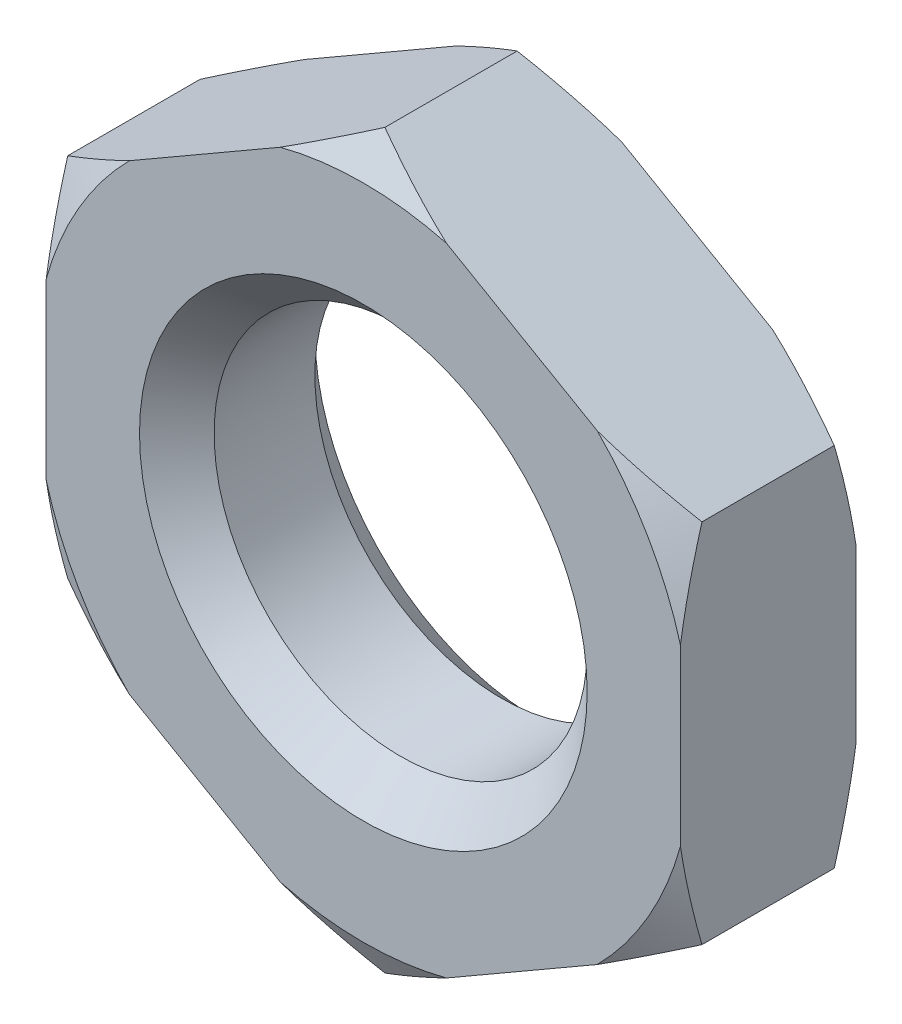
ISO-10303-21;
HEADER;
FILE_DESCRIPTION(('STEP AP214'),'2;1');
FILE_NAME('part.step','',(''),(''),'','','');
FILE_SCHEMA(('AUTOMOTIVE_DESIGN { 1 0 10303 214 1 1 1 1 }'));
ENDSEC;
DATA;
#1=APPLICATION_CONTEXT('core data for automotive mechanical design processes');
#2=APPLICATION_PROTOCOL_DEFINITION('international standard','automotive_design',2000,#1);
#3=PRODUCT_CONTEXT('',#1,'mechanical');
#4=PRODUCT('Part','Part','',(#3));
#5=PRODUCT_RELATED_PRODUCT_CATEGORY('part','',(#4));
#6=PRODUCT_DEFINITION_FORMATION('','',#4);
#7=PRODUCT_DEFINITION_CONTEXT('part definition',#1,'design');
#8=PRODUCT_DEFINITION('design','',#6,#7);
#9=PRODUCT_DEFINITION_SHAPE('','',#8);
#10=(LENGTH_UNIT() NAMED_UNIT(*) SI_UNIT(.MILLI.,.METRE.));
#11=(NAMED_UNIT(*) PLANE_ANGLE_UNIT() SI_UNIT($,.RADIAN.));
#12=(NAMED_UNIT(*) SI_UNIT($,.STERADIAN.) SOLID_ANGLE_UNIT());
#13=UNCERTAINTY_MEASURE_WITH_UNIT(LENGTH_MEASURE(1.E-05),#10,'distance_accuracy_value','');
#14=(GEOMETRIC_REPRESENTATION_CONTEXT(3) GLOBAL_UNCERTAINTY_ASSIGNED_CONTEXT((#13)) GLOBAL_UNIT_ASSIGNED_CONTEXT((#10,
#11,#12)) REPRESENTATION_CONTEXT('',''));
#15=CARTESIAN_POINT('',(0.,0.,0.));
#16=DIRECTION('',(0.,0.,1.));
#17=DIRECTION('',(1.,0.,0.));
#18=AXIS2_PLACEMENT_3D('',#15,#16,#17);
#19=CARTESIAN_POINT('',(0.,0.,-2.35));
#20=DIRECTION('',(0.,0.,1.));
#21=DIRECTION('',(1.,0.,0.));
#22=AXIS2_PLACEMENT_3D('',#19,#20,#21);
#23=PLANE('',#22);
#24=CARTESIAN_POINT('',(0.,0.,-2.35));
#25=DIRECTION('',(0.,0.,1.));
#26=DIRECTION('',(1.,0.,0.));
#27=AXIS2_PLACEMENT_3D('',#24,#25,#26);
#28=CIRCLE('',#27,6.);
#29=CARTESIAN_POINT('',(6.,0.,-2.35));
#30=VERTEX_POINT('',#29);
#31=EDGE_CURVE('E427',#30,#30,#28,.T.);
#32=ORIENTED_EDGE('',*,*,#31,.T.);
#33=EDGE_LOOP('',(#32));
#34=FACE_BOUND('',#33,.T.);
#35=DIRECTION('',(0.,1.,0.));
#36=VECTOR('',#35,1.);
#37=CARTESIAN_POINT('',(8.5,-4.90747728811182,-2.35));
#38=LINE('',#37,#36);
#39=CARTESIAN_POINT('',(8.5,-2.33525676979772,-2.35));
#40=VERTEX_POINT('',#39);
#41=CARTESIAN_POINT('',(8.5,2.33525676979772,-2.35));
#42=VERTEX_POINT('',#41);
#43=EDGE_CURVE('E362',#40,#42,#38,.T.);
#44=ORIENTED_EDGE('',*,*,#43,.F.);
#45=CARTESIAN_POINT('',(0.,0.,-2.35));
#46=DIRECTION('',(0.,0.,-1.));
#47=DIRECTION('',(-1.,0.,0.));
#48=AXIS2_PLACEMENT_3D('',#45,#46,#47);
#49=CIRCLE('',#48,8.81495457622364);
#50=CARTESIAN_POINT('',(6.2723916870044,-6.19358754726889,-2.35));
#51=VERTEX_POINT('',#50);
#52=EDGE_CURVE('E351',#40,#51,#49,.T.);
#53=ORIENTED_EDGE('',*,*,#52,.T.);
#54=DIRECTION('',(0.866025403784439,0.5,0.));
#55=VECTOR('',#54,1.);
#56=CARTESIAN_POINT('',(0.,-9.81495457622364,-2.35));
#57=LINE('',#56,#55);
#58=CARTESIAN_POINT('',(2.2276083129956,-8.52884431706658,-2.35));
#59=VERTEX_POINT('',#58);
#60=EDGE_CURVE('E372',#59,#51,#57,.T.);
#61=ORIENTED_EDGE('',*,*,#60,.F.);
#62=CARTESIAN_POINT('',(-2.22760831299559,-8.52884431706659,-2.35));
#63=VERTEX_POINT('',#62);
#64=EDGE_CURVE('E345',#59,#63,#49,.T.);
#65=ORIENTED_EDGE('',*,*,#64,.T.);
#66=DIRECTION('',(0.866025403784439,-0.5,0.));
#67=VECTOR('',#66,1.);
#68=CARTESIAN_POINT('',(-8.5,-4.90747728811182,-2.35));
#69=LINE('',#68,#67);
#70=CARTESIAN_POINT('',(-6.27239168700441,-6.19358754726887,-2.35));
#71=VERTEX_POINT('',#70);
#72=EDGE_CURVE('E379',#71,#63,#69,.T.);
#73=ORIENTED_EDGE('',*,*,#72,.F.);
#74=CARTESIAN_POINT('',(-8.5,-2.33525676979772,-2.35));
#75=VERTEX_POINT('',#74);
#76=EDGE_CURVE('E337',#71,#75,#49,.T.);
#77=ORIENTED_EDGE('',*,*,#76,.T.);
#78=DIRECTION('',(0.,-1.,0.));
#79=VECTOR('',#78,1.);
#80=CARTESIAN_POINT('',(-8.5,4.90747728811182,-2.35));
#81=LINE('',#80,#79);
#82=CARTESIAN_POINT('',(-8.5,2.33525676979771,-2.35));
#83=VERTEX_POINT('',#82);
#84=EDGE_CURVE('E480',#83,#75,#81,.T.);
#85=ORIENTED_EDGE('',*,*,#84,.F.);
#86=CARTESIAN_POINT('',(-6.27239168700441,6.19358754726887,-2.35));
#87=VERTEX_POINT('',#86);
#88=EDGE_CURVE('E63',#83,#87,#49,.T.);
#89=ORIENTED_EDGE('',*,*,#88,.T.);
#90=DIRECTION('',(-0.866025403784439,-0.5,0.));
#91=VECTOR('',#90,1.);
#92=CARTESIAN_POINT('',(0.,9.81495457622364,-2.35));
#93=LINE('',#92,#91);
#94=CARTESIAN_POINT('',(-2.22760831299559,8.52884431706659,-2.35));
#95=VERTEX_POINT('',#94);
#96=EDGE_CURVE('E181',#95,#87,#93,.T.);
#97=ORIENTED_EDGE('',*,*,#96,.F.);
#98=CARTESIAN_POINT('',(2.2276083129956,8.52884431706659,-2.35));
#99=VERTEX_POINT('',#98);
#100=EDGE_CURVE('E55',#95,#99,#49,.T.);
#101=ORIENTED_EDGE('',*,*,#100,.T.);
#102=DIRECTION('',(-0.866025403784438,0.5,0.));
#103=VECTOR('',#102,1.);
#104=CARTESIAN_POINT('',(8.5,4.90747728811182,-2.35));
#105=LINE('',#104,#103);
#106=CARTESIAN_POINT('',(6.27239168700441,6.19358754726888,-2.35));
#107=VERTEX_POINT('',#106);
#108=EDGE_CURVE('E363',#107,#99,#105,.T.);
#109=ORIENTED_EDGE('',*,*,#108,.F.);
#110=EDGE_CURVE('E342',#107,#42,#49,.T.);
#111=ORIENTED_EDGE('',*,*,#110,.T.);
#112=EDGE_LOOP('',(#44,#53,#61,#65,#73,#77,#85,#89,#97,#101,#109,#111));
#113=FACE_BOUND('',#112,.T.);
#114=ADVANCED_FACE('F39',(#34,#113),#23,.F.);
#115=CARTESIAN_POINT('',(0.,0.,2.35));
#116=DIRECTION('',(0.,0.,1.));
#117=DIRECTION('',(1.,0.,0.));
#118=AXIS2_PLACEMENT_3D('',#115,#116,#117);
#119=PLANE('',#118);
#120=CARTESIAN_POINT('',(0.,0.,2.35));
#121=DIRECTION('',(0.,0.,1.));
#122=DIRECTION('',(1.,0.,0.));
#123=AXIS2_PLACEMENT_3D('',#120,#121,#122);
#124=CIRCLE('',#123,6.);
#125=CARTESIAN_POINT('',(6.,0.,2.35));
#126=VERTEX_POINT('',#125);
#127=EDGE_CURVE('E11',#126,#126,#124,.F.);
#128=ORIENTED_EDGE('',*,*,#127,.T.);
#129=EDGE_LOOP('',(#128));
#130=FACE_BOUND('',#129,.T.);
#131=CARTESIAN_POINT('',(0.,0.,2.35));
#132=DIRECTION('',(0.,0.,-1.));
#133=DIRECTION('',(-1.,0.,0.));
#134=AXIS2_PLACEMENT_3D('',#131,#132,#133);
#135=CIRCLE('',#134,8.81495457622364);
#136=CARTESIAN_POINT('',(8.5,-2.33525676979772,2.35));
#137=VERTEX_POINT('',#136);
#138=CARTESIAN_POINT('',(6.2723916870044,-6.19358754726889,2.35));
#139=VERTEX_POINT('',#138);
#140=EDGE_CURVE('E315',#137,#139,#135,.T.);
#141=ORIENTED_EDGE('',*,*,#140,.F.);
#142=DIRECTION('',(0.,1.,0.));
#143=VECTOR('',#142,1.);
#144=CARTESIAN_POINT('',(8.5,-4.90747728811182,2.35));
#145=LINE('',#144,#143);
#146=CARTESIAN_POINT('',(8.5,2.33525676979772,2.35));
#147=VERTEX_POINT('',#146);
#148=EDGE_CURVE('E387',#137,#147,#145,.T.);
#149=ORIENTED_EDGE('',*,*,#148,.T.);
#150=CARTESIAN_POINT('',(6.27239168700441,6.19358754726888,2.35));
#151=VERTEX_POINT('',#150);
#152=EDGE_CURVE('E306',#151,#147,#135,.T.);
#153=ORIENTED_EDGE('',*,*,#152,.F.);
#154=DIRECTION('',(-0.866025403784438,0.5,0.));
#155=VECTOR('',#154,1.);
#156=CARTESIAN_POINT('',(8.5,4.90747728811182,2.35));
#157=LINE('',#156,#155);
#158=CARTESIAN_POINT('',(2.2276083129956,8.52884431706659,2.35));
#159=VERTEX_POINT('',#158);
#160=EDGE_CURVE('E371',#151,#159,#157,.T.);
#161=ORIENTED_EDGE('',*,*,#160,.T.);
#162=CARTESIAN_POINT('',(-2.22760831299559,8.52884431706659,2.35));
#163=VERTEX_POINT('',#162);
#164=EDGE_CURVE('E296',#163,#159,#135,.T.);
#165=ORIENTED_EDGE('',*,*,#164,.F.);
#166=DIRECTION('',(-0.866025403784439,-0.5,0.));
#167=VECTOR('',#166,1.);
#168=CARTESIAN_POINT('',(0.,9.81495457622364,2.35));
#169=LINE('',#168,#167);
#170=CARTESIAN_POINT('',(-6.27239168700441,6.19358754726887,2.35));
#171=VERTEX_POINT('',#170);
#172=EDGE_CURVE('E377',#163,#171,#169,.T.);
#173=ORIENTED_EDGE('',*,*,#172,.T.);
#174=CARTESIAN_POINT('',(-8.5,2.33525676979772,2.35));
#175=VERTEX_POINT('',#174);
#176=EDGE_CURVE('E294',#175,#171,#135,.T.);
#177=ORIENTED_EDGE('',*,*,#176,.F.);
#178=DIRECTION('',(0.,-1.,0.));
#179=VECTOR('',#178,1.);
#180=CARTESIAN_POINT('',(-8.5,4.90747728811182,2.35));
#181=LINE('',#180,#179);
#182=CARTESIAN_POINT('',(-8.5,-2.33525676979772,2.35));
#183=VERTEX_POINT('',#182);
#184=EDGE_CURVE('E492',#175,#183,#181,.T.);
#185=ORIENTED_EDGE('',*,*,#184,.T.);
#186=CARTESIAN_POINT('',(-6.27239168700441,-6.19358754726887,2.35));
#187=VERTEX_POINT('',#186);
#188=EDGE_CURVE('E297',#187,#183,#135,.T.);
#189=ORIENTED_EDGE('',*,*,#188,.F.);
#190=DIRECTION('',(0.866025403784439,-0.5,0.));
#191=VECTOR('',#190,1.);
#192=CARTESIAN_POINT('',(-8.5,-4.90747728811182,2.35));
#193=LINE('',#192,#191);
#194=CARTESIAN_POINT('',(-2.22760831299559,-8.52884431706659,2.35));
#195=VERTEX_POINT('',#194);
#196=EDGE_CURVE('E472',#187,#195,#193,.T.);
#197=ORIENTED_EDGE('',*,*,#196,.T.);
#198=CARTESIAN_POINT('',(2.2276083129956,-8.52884431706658,2.35));
#199=VERTEX_POINT('',#198);
#200=EDGE_CURVE('E308',#199,#195,#135,.T.);
#201=ORIENTED_EDGE('',*,*,#200,.F.);
#202=DIRECTION('',(0.866025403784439,0.5,0.));
#203=VECTOR('',#202,1.);
#204=CARTESIAN_POINT('',(0.,-9.81495457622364,2.35));
#205=LINE('',#204,#203);
#206=EDGE_CURVE('E467',#199,#139,#205,.T.);
#207=ORIENTED_EDGE('',*,*,#206,.T.);
#208=EDGE_LOOP('',(#141,#149,#153,#161,#165,#173,#177,#185,#189,#197,#201,#207));
#209=FACE_BOUND('',#208,.T.);
#210=ADVANCED_FACE('F418',(#130,#209),#119,.T.);
#211=CARTESIAN_POINT('',(8.5,4.90747728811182,2.35));
#212=DIRECTION('',(-0.5,-0.866025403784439,0.));
#213=DIRECTION('',(0.866025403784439,-0.5,0.));
#214=AXIS2_PLACEMENT_3D('',#211,#212,#213);
#215=PLANE('',#214);
#216=DIRECTION('',(0.,0.,-1.));
#217=VECTOR('',#216,1.);
#218=CARTESIAN_POINT('',(8.5,4.90747728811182,2.35));
#219=LINE('',#218,#217);
#220=CARTESIAN_POINT('',(8.5,4.90747728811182,1.77264973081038));
#221=VERTEX_POINT('',#220);
#222=CARTESIAN_POINT('',(8.5,4.90747728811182,-1.77264973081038));
#223=VERTEX_POINT('',#222);
#224=EDGE_CURVE('E383',#221,#223,#219,.T.);
#225=ORIENTED_EDGE('',*,*,#224,.T.);
#226=CARTESIAN_POINT('',(14.399352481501,1.5014845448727,0.919228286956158));
#227=CARTESIAN_POINT('',(14.1323061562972,1.65566381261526,0.77514357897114));
#228=CARTESIAN_POINT('',(13.8646205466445,1.81021217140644,0.632614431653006));
#229=CARTESIAN_POINT('',(13.3277011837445,2.12020271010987,0.351397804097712));
#230=CARTESIAN_POINT('',(13.0584672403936,2.27564499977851,0.212710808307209));
#231=CARTESIAN_POINT('',(12.5173808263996,2.58804138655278,-0.0604925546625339));
#232=CARTESIAN_POINT('',(12.2455227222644,2.7449987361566,-0.194994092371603));
#233=CARTESIAN_POINT('',(11.6997690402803,3.06008977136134,-0.458355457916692));
#234=CARTESIAN_POINT('',(11.4258735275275,3.21822341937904,-0.587215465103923));
#235=CARTESIAN_POINT('',(10.8687339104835,3.53988812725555,-0.841243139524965));
#236=CARTESIAN_POINT('',(10.5854290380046,3.70345427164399,-0.966233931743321));
#237=CARTESIAN_POINT('',(10.0159609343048,4.03223683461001,-1.20730558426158));
#238=CARTESIAN_POINT('',(9.72979756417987,4.19745333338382,-1.32338600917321));
#239=CARTESIAN_POINT('',(9.15454636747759,4.52957476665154,-1.54442576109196));
#240=CARTESIAN_POINT('',(8.8654616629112,4.69647789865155,-1.64939581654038));
#241=CARTESIAN_POINT('',(8.28389822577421,5.03224370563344,-1.84579039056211));
#242=CARTESIAN_POINT('',(7.99141993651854,5.20110612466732,-1.93721665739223));
#243=CARTESIAN_POINT('',(7.29191866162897,5.6049633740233,-2.1349622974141));
#244=CARTESIAN_POINT('',(6.88326573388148,5.84089925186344,-2.23391032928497));
#245=CARTESIAN_POINT('',(6.26611138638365,6.19721348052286,-2.35280449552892));
#246=CARTESIAN_POINT('',(6.05970744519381,6.31638085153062,-2.38751361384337));
#247=CARTESIAN_POINT('',(5.64574324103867,6.55538319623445,-2.44622187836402));
#248=CARTESIAN_POINT('',(5.438182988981,6.67521816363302,-2.47022112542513));
#249=CARTESIAN_POINT('',(5.02471822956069,6.91393215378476,-2.50660542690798));
#250=CARTESIAN_POINT('',(4.8188224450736,7.03280614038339,-2.51912197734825));
#251=CARTESIAN_POINT('',(4.40674655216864,7.27071826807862,-2.53264400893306));
#252=CARTESIAN_POINT('',(4.20056644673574,7.38975640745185,-2.53364961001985));
#253=CARTESIAN_POINT('',(3.78840865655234,7.62771581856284,-2.52411772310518));
#254=CARTESIAN_POINT('',(3.5824309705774,7.74663709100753,-2.513580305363));
#255=CARTESIAN_POINT('',(3.17111495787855,7.98411050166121,-2.48128123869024));
#256=CARTESIAN_POINT('',(2.9657767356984,8.10266257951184,-2.45951784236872));
#257=CARTESIAN_POINT('',(2.48062586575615,8.38276456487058,-2.39538732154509));
#258=CARTESIAN_POINT('',(2.20126952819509,8.54405102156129,-2.34838202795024));
#259=CARTESIAN_POINT('',(1.64523215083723,8.86507935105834,-2.23667031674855));
#260=CARTESIAN_POINT('',(1.36855150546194,9.02482099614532,-2.17196132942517));
#261=CARTESIAN_POINT('',(0.817898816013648,9.34274047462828,-2.02728510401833));
#262=CARTESIAN_POINT('',(0.54393020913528,9.50091632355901,-1.9473006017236));
#263=CARTESIAN_POINT('',(-0.000931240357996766,9.81549222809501,-1.77459301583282));
#264=CARTESIAN_POINT('',(-0.271824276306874,9.97189239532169,-1.68187073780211));
#265=CARTESIAN_POINT('',(-0.813928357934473,10.2848763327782,-1.48472368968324));
#266=CARTESIAN_POINT('',(-1.08510471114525,10.4414400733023,-1.38017261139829));
#267=CARTESIAN_POINT('',(-1.62458458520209,10.7529089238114,-1.16229593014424));
#268=CARTESIAN_POINT('',(-1.8928898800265,10.9078150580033,-1.04897614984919));
#269=CARTESIAN_POINT('',(-2.42705527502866,11.2162155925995,-0.815117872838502));
#270=CARTESIAN_POINT('',(-2.69291587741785,11.3697102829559,-0.694580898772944));
#271=CARTESIAN_POINT('',(-3.22255292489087,11.6754963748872,-0.447551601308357));
#272=CARTESIAN_POINT('',(-3.48632933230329,11.8277877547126,-0.321059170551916));
#273=CARTESIAN_POINT('',(-3.93084580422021,12.0844294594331,-0.10299471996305));
#274=CARTESIAN_POINT('',(-4.11206097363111,12.1890540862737,-0.0127085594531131));
#275=CARTESIAN_POINT('',(-4.47370041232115,12.397846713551,0.169932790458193));
#276=CARTESIAN_POINT('',(-4.6541247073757,12.5020147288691,0.2622879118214));
#277=CARTESIAN_POINT('',(-5.01237142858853,12.7088485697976,0.447844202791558));
#278=CARTESIAN_POINT('',(-5.19020127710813,12.8115186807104,0.541026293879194));
#279=CARTESIAN_POINT('',(-5.5452327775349,13.0164962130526,0.728982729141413));
#280=CARTESIAN_POINT('',(-5.72243441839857,13.118803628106,0.823757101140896));
#281=CARTESIAN_POINT('',(-5.89935248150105,13.2209473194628,0.919228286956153));
#282=B_SPLINE_CURVE_WITH_KNOTS('',3,(#226,#227,#228,#229,#230,#231,#232,#233,#234,#235,#236,
#237,#238,#239,#240,#241,#242,#243,#244,#245,#246,#247,#248,#249,#250,#251,#252,#253,#254,#255,
#256,#257,#258,#259,#260,#261,#262,#263,#264,#265,#266,#267,#268,#269,#270,#271,#272,#273,#274,
#275,#276,#277,#278,#279,#280,#281),.UNSPECIFIED.,.F.,.F.,(4,2,2,2,2,2,2,2,2,2,2,2,2,2,2,2,2,2,
2,2,2,2,2,2,2,2,2,4),(0.,1.02109297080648,2.04231410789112,3.06681592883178,4.09128515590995,
5.14177132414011,6.19230878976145,7.24182239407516,8.29120040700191,9.73603308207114,
10.4583801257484,11.1807203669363,11.894681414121,12.6086350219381,13.3225842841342,
14.0366447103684,15.0139923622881,15.9914819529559,16.970082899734,17.9486219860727,
18.9388241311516,19.9283743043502,20.9177164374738,21.9070764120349,22.5907552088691,
23.274411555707,23.9508863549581,24.6273729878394),.UNSPECIFIED.);
#283=EDGE_CURVE('E319',#223,#107,#282,.T.);
#284=ORIENTED_EDGE('',*,*,#283,.T.);
#285=ORIENTED_EDGE('',*,*,#108,.T.);
#286=CARTESIAN_POINT('',(0.,9.81495457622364,-1.77264973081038));
#287=VERTEX_POINT('',#286);
#288=EDGE_CURVE('E309',#99,#287,#282,.T.);
#289=ORIENTED_EDGE('',*,*,#288,.T.);
#290=DIRECTION('',(0.,0.,-1.));
#291=VECTOR('',#290,1.);
#292=CARTESIAN_POINT('',(0.,9.81495457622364,2.35));
#293=LINE('',#292,#291);
#294=CARTESIAN_POINT('',(0.,9.81495457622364,1.77264973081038));
#295=VERTEX_POINT('',#294);
#296=EDGE_CURVE('E190',#295,#287,#293,.T.);
#297=ORIENTED_EDGE('',*,*,#296,.F.);
#298=CARTESIAN_POINT('',(-5.89935248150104,13.2209473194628,-0.91922828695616));
#299=CARTESIAN_POINT('',(-5.63230615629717,13.0667680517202,-0.775143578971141));
#300=CARTESIAN_POINT('',(-5.36462054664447,12.912219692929,-0.632614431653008));
#301=CARTESIAN_POINT('',(-4.82770118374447,12.6022291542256,-0.351397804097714));
#302=CARTESIAN_POINT('',(-4.55846724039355,12.4467868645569,-0.21271080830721));
#303=CARTESIAN_POINT('',(-4.01738082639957,12.1343904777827,0.0604925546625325));
#304=CARTESIAN_POINT('',(-3.74552272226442,11.9774331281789,0.194994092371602));
#305=CARTESIAN_POINT('',(-3.19976904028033,11.6623420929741,0.45835545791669));
#306=CARTESIAN_POINT('',(-2.92587352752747,11.5042084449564,0.58721546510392));
#307=CARTESIAN_POINT('',(-2.36873391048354,11.1825437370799,0.841243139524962));
#308=CARTESIAN_POINT('',(-2.08542903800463,11.0189775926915,0.966233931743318));
#309=CARTESIAN_POINT('',(-1.51596093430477,10.6901950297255,1.20730558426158));
#310=CARTESIAN_POINT('',(-1.22979756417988,10.5249785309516,1.32338600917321));
#311=CARTESIAN_POINT('',(-0.654546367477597,10.1928570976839,1.54442576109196));
#312=CARTESIAN_POINT('',(-0.365461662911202,10.0259539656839,1.64939581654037));
#313=CARTESIAN_POINT('',(0.216101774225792,9.69018815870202,1.84579039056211));
#314=CARTESIAN_POINT('',(0.508580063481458,9.52132573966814,1.93721665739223));
#315=CARTESIAN_POINT('',(1.20808133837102,9.11746849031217,2.1349622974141));
#316=CARTESIAN_POINT('',(1.61673426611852,8.88153261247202,2.23391032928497));
#317=CARTESIAN_POINT('',(2.23388861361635,8.5252183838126,2.35280449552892));
#318=CARTESIAN_POINT('',(2.44029255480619,8.40605101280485,2.38751361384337));
#319=CARTESIAN_POINT('',(2.85425675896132,8.16704866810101,2.44622187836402));
#320=CARTESIAN_POINT('',(3.061817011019,8.04721370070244,2.47022112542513));
#321=CARTESIAN_POINT('',(3.47528177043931,7.80849971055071,2.50660542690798));
#322=CARTESIAN_POINT('',(3.6811775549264,7.68962572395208,2.51912197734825));
#323=CARTESIAN_POINT('',(4.09325344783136,7.45171359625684,2.53264400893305));
#324=CARTESIAN_POINT('',(4.29943355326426,7.33267545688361,2.53364961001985));
#325=CARTESIAN_POINT('',(4.71159134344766,7.09471604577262,2.52411772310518));
#326=CARTESIAN_POINT('',(4.9175690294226,6.97579477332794,2.513580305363));
#327=CARTESIAN_POINT('',(5.32888504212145,6.73832136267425,2.48128123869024));
#328=CARTESIAN_POINT('',(5.5342232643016,6.61976928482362,2.45951784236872));
#329=CARTESIAN_POINT('',(6.01937413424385,6.33966729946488,2.39538732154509));
#330=CARTESIAN_POINT('',(6.29873047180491,6.17838084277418,2.34838202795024));
#331=CARTESIAN_POINT('',(6.85476784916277,5.85735251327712,2.23667031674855));
#332=CARTESIAN_POINT('',(7.13144849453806,5.69761086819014,2.17196132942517));
#333=CARTESIAN_POINT('',(7.68210118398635,5.37969138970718,2.02728510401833));
#334=CARTESIAN_POINT('',(7.95606979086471,5.22151554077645,1.9473006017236));
#335=CARTESIAN_POINT('',(8.50093124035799,4.90693963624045,1.77459301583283));
#336=CARTESIAN_POINT('',(8.77182427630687,4.75053946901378,1.68187073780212));
#337=CARTESIAN_POINT('',(9.31392835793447,4.43755553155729,1.48472368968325));
#338=CARTESIAN_POINT('',(9.58510471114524,4.28099179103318,1.3801726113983));
#339=CARTESIAN_POINT('',(10.1245845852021,3.96952294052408,1.16229593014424));
#340=CARTESIAN_POINT('',(10.3928898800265,3.81461680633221,1.0489761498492));
#341=CARTESIAN_POINT('',(10.9270552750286,3.50621627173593,0.815117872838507));
#342=CARTESIAN_POINT('',(11.1929158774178,3.35272158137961,0.694580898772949));
#343=CARTESIAN_POINT('',(11.7225529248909,3.04693548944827,0.447551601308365));
#344=CARTESIAN_POINT('',(11.9863293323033,2.89464410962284,0.321059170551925));
#345=CARTESIAN_POINT('',(12.4308458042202,2.63800240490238,0.102994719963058));
#346=CARTESIAN_POINT('',(12.6120609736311,2.53337777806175,0.0127085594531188));
#347=CARTESIAN_POINT('',(12.9737004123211,2.32458515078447,-0.169932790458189));
#348=CARTESIAN_POINT('',(13.1541247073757,2.22041713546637,-0.262287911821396));
#349=CARTESIAN_POINT('',(13.5123714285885,2.01358329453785,-0.447844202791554));
#350=CARTESIAN_POINT('',(13.6902012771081,1.9109131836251,-0.541026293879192));
#351=CARTESIAN_POINT('',(14.0452327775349,1.70593565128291,-0.728982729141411));
#352=CARTESIAN_POINT('',(14.2224344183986,1.60362823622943,-0.823757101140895));
#353=CARTESIAN_POINT('',(14.399352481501,1.5014845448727,-0.919228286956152));
#354=B_SPLINE_CURVE_WITH_KNOTS('',3,(#298,#299,#300,#301,#302,#303,#304,#305,#306,#307,#308,
#309,#310,#311,#312,#313,#314,#315,#316,#317,#318,#319,#320,#321,#322,#323,#324,#325,#326,#327,
#328,#329,#330,#331,#332,#333,#334,#335,#336,#337,#338,#339,#340,#341,#342,#343,#344,#345,#346,
#347,#348,#349,#350,#351,#352,#353),.UNSPECIFIED.,.F.,.F.,(4,2,2,2,2,2,2,2,2,2,2,2,2,2,2,2,2,2,
2,2,2,2,2,2,2,2,2,4),(0.,1.02109297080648,2.04231410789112,3.06681592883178,4.09128515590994,
5.14177132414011,6.19230878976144,7.24182239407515,8.2912004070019,9.73603308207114,
10.4583801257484,11.1807203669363,11.894681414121,12.6086350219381,13.3225842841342,
14.0366447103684,15.0139923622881,15.9914819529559,16.9700828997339,17.9486219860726,
18.9388241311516,19.9283743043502,20.9177164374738,21.9070764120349,22.5907552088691,
23.2744115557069,23.9508863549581,24.6273729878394),.UNSPECIFIED.);
#355=EDGE_CURVE('E478',#295,#159,#354,.T.);
#356=ORIENTED_EDGE('',*,*,#355,.T.);
#357=ORIENTED_EDGE('',*,*,#160,.F.);
#358=EDGE_CURVE('E247',#151,#221,#354,.T.);
#359=ORIENTED_EDGE('',*,*,#358,.T.);
#360=EDGE_LOOP('',(#225,#284,#285,#289,#297,#356,#357,#359));
#361=FACE_BOUND('',#360,.T.);
#362=ADVANCED_FACE('F423',(#361),#215,.F.);
#363=CARTESIAN_POINT('',(0.,9.81495457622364,2.35));
#364=DIRECTION('',(0.5,-0.866025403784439,0.));
#365=DIRECTION('',(0.866025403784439,0.5,0.));
#366=AXIS2_PLACEMENT_3D('',#363,#364,#365);
#367=PLANE('',#366);
#368=ORIENTED_EDGE('',*,*,#296,.T.);
#369=CARTESIAN_POINT('',(5.89935248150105,13.2209473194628,0.919228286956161));
#370=CARTESIAN_POINT('',(5.63230615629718,13.0667680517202,0.775143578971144));
#371=CARTESIAN_POINT('',(5.36462054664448,12.912219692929,0.63261443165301));
#372=CARTESIAN_POINT('',(4.82770118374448,12.6022291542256,0.351397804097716));
#373=CARTESIAN_POINT('',(4.55846724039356,12.4467868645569,0.212710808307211));
#374=CARTESIAN_POINT('',(4.01738082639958,12.1343904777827,-0.0604925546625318));
#375=CARTESIAN_POINT('',(3.74552272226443,11.9774331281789,-0.194994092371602));
#376=CARTESIAN_POINT('',(3.19976904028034,11.6623420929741,-0.458355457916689));
#377=CARTESIAN_POINT('',(2.92587352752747,11.5042084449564,-0.58721546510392));
#378=CARTESIAN_POINT('',(2.36873391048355,11.1825437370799,-0.841243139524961));
#379=CARTESIAN_POINT('',(2.08542903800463,11.0189775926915,-0.966233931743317));
#380=CARTESIAN_POINT('',(1.51596093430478,10.6901950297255,-1.20730558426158));
#381=CARTESIAN_POINT('',(1.22979756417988,10.5249785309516,-1.32338600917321));
#382=CARTESIAN_POINT('',(0.654546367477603,10.1928570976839,-1.54442576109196));
#383=CARTESIAN_POINT('',(0.365461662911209,10.0259539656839,-1.64939581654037));
#384=CARTESIAN_POINT('',(-0.216101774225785,9.69018815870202,-1.84579039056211));
#385=CARTESIAN_POINT('',(-0.508580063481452,9.52132573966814,-1.93721665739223));
#386=CARTESIAN_POINT('',(-1.20808133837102,9.11746849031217,-2.1349622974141));
#387=CARTESIAN_POINT('',(-1.61673426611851,8.88153261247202,-2.23391032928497));
#388=CARTESIAN_POINT('',(-2.23388861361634,8.5252183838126,-2.35280449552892));
#389=CARTESIAN_POINT('',(-2.44029255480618,8.40605101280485,-2.38751361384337));
#390=CARTESIAN_POINT('',(-2.85425675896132,8.16704866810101,-2.44622187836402));
#391=CARTESIAN_POINT('',(-3.06181701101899,8.04721370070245,-2.47022112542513));
#392=CARTESIAN_POINT('',(-3.4752817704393,7.80849971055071,-2.50660542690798));
#393=CARTESIAN_POINT('',(-3.68117755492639,7.68962572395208,-2.51912197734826));
#394=CARTESIAN_POINT('',(-4.09325344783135,7.45171359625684,-2.53264400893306));
#395=CARTESIAN_POINT('',(-4.29943355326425,7.33267545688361,-2.53364961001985));
#396=CARTESIAN_POINT('',(-4.71159134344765,7.09471604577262,-2.52411772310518));
#397=CARTESIAN_POINT('',(-4.91756902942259,6.97579477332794,-2.513580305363));
#398=CARTESIAN_POINT('',(-5.32888504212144,6.73832136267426,-2.48128123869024));
#399=CARTESIAN_POINT('',(-5.53422326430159,6.61976928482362,-2.45951784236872));
#400=CARTESIAN_POINT('',(-6.01937413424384,6.33966729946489,-2.3953873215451));
#401=CARTESIAN_POINT('',(-6.2987304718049,6.17838084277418,-2.34838202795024));
#402=CARTESIAN_POINT('',(-6.85476784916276,5.85735251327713,-2.23667031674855));
#403=CARTESIAN_POINT('',(-7.13144849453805,5.69761086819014,-2.17196132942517));
#404=CARTESIAN_POINT('',(-7.68210118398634,5.37969138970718,-2.02728510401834));
#405=CARTESIAN_POINT('',(-7.9560697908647,5.22151554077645,-1.94730060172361));
#406=CARTESIAN_POINT('',(-8.50093124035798,4.90693963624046,-1.77459301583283));
#407=CARTESIAN_POINT('',(-8.77182427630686,4.75053946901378,-1.68187073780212));
#408=CARTESIAN_POINT('',(-9.31392835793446,4.43755553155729,-1.48472368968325));
#409=CARTESIAN_POINT('',(-9.58510471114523,4.28099179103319,-1.3801726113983));
#410=CARTESIAN_POINT('',(-10.1245845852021,3.96952294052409,-1.16229593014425));
#411=CARTESIAN_POINT('',(-10.3928898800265,3.81461680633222,-1.0489761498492));
#412=CARTESIAN_POINT('',(-10.9270552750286,3.50621627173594,-0.815117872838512));
#413=CARTESIAN_POINT('',(-11.1929158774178,3.35272158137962,-0.694580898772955));
#414=CARTESIAN_POINT('',(-11.7225529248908,3.04693548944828,-0.447551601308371));
#415=CARTESIAN_POINT('',(-11.9863293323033,2.89464410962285,-0.321059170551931));
#416=CARTESIAN_POINT('',(-12.4308458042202,2.63800240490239,-0.102994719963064));
#417=CARTESIAN_POINT('',(-12.6120609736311,2.53337777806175,-0.0127085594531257));
#418=CARTESIAN_POINT('',(-12.9737004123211,2.32458515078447,0.169932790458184));
#419=CARTESIAN_POINT('',(-13.1541247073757,2.22041713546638,0.262287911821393));
#420=CARTESIAN_POINT('',(-13.5123714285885,2.01358329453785,0.447844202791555));
#421=CARTESIAN_POINT('',(-13.6902012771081,1.9109131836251,0.541026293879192));
#422=CARTESIAN_POINT('',(-14.0452327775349,1.7059356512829,0.728982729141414));
#423=CARTESIAN_POINT('',(-14.2224344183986,1.60362823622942,0.823757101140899));
#424=CARTESIAN_POINT('',(-14.3993524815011,1.5014845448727,0.919228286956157));
#425=B_SPLINE_CURVE_WITH_KNOTS('',3,(#369,#370,#371,#372,#373,#374,#375,#376,#377,#378,#379,
#380,#381,#382,#383,#384,#385,#386,#387,#388,#389,#390,#391,#392,#393,#394,#395,#396,#397,#398,
#399,#400,#401,#402,#403,#404,#405,#406,#407,#408,#409,#410,#411,#412,#413,#414,#415,#416,#417,
#418,#419,#420,#421,#422,#423,#424),.UNSPECIFIED.,.F.,.F.,(4,2,2,2,2,2,2,2,2,2,2,2,2,2,2,2,2,2,
2,2,2,2,2,2,2,2,2,4),(0.,1.02109297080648,2.04231410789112,3.06681592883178,4.09128515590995,
5.14177132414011,6.19230878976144,7.24182239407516,8.29120040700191,9.73603308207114,
10.4583801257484,11.1807203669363,11.894681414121,12.6086350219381,13.3225842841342,
14.0366447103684,15.0139923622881,15.9914819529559,16.9700828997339,17.9486219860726,
18.9388241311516,19.9283743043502,20.9177164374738,21.9070764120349,22.5907552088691,
23.274411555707,23.9508863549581,24.6273729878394),.UNSPECIFIED.);
#426=EDGE_CURVE('E183',#287,#95,#425,.T.);
#427=ORIENTED_EDGE('',*,*,#426,.T.);
#428=ORIENTED_EDGE('',*,*,#96,.T.);
#429=CARTESIAN_POINT('',(-8.5,4.90747728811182,-1.77264973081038));
#430=VERTEX_POINT('',#429);
#431=EDGE_CURVE('E165',#87,#430,#425,.T.);
#432=ORIENTED_EDGE('',*,*,#431,.T.);
#433=DIRECTION('',(0.,0.,-1.));
#434=VECTOR('',#433,1.);
#435=CARTESIAN_POINT('',(-8.5,4.90747728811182,2.35));
#436=LINE('',#435,#434);
#437=CARTESIAN_POINT('',(-8.5,4.90747728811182,1.77264973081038));
#438=VERTEX_POINT('',#437);
#439=EDGE_CURVE('E179',#438,#430,#436,.T.);
#440=ORIENTED_EDGE('',*,*,#439,.F.);
#441=CARTESIAN_POINT('',(-14.3993524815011,1.5014845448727,-0.919228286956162));
#442=CARTESIAN_POINT('',(-14.1323061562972,1.65566381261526,-0.775143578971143));
#443=CARTESIAN_POINT('',(-13.8646205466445,1.81021217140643,-0.632614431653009));
#444=CARTESIAN_POINT('',(-13.3277011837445,2.12020271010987,-0.351397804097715));
#445=CARTESIAN_POINT('',(-13.0584672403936,2.27564499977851,-0.212710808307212));
#446=CARTESIAN_POINT('',(-12.5173808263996,2.58804138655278,0.0604925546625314));
#447=CARTESIAN_POINT('',(-12.2455227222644,2.74499873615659,0.194994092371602));
#448=CARTESIAN_POINT('',(-11.6997690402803,3.06008977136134,0.458355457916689));
#449=CARTESIAN_POINT('',(-11.4258735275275,3.21822341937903,0.587215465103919));
#450=CARTESIAN_POINT('',(-10.8687339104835,3.53988812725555,0.84124313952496));
#451=CARTESIAN_POINT('',(-10.5854290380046,3.70345427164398,0.966233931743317));
#452=CARTESIAN_POINT('',(-10.0159609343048,4.03223683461,1.20730558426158));
#453=CARTESIAN_POINT('',(-9.72979756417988,4.19745333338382,1.32338600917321));
#454=CARTESIAN_POINT('',(-9.1545463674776,4.52957476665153,1.54442576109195));
#455=CARTESIAN_POINT('',(-8.86546166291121,4.69647789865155,1.64939581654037));
#456=CARTESIAN_POINT('',(-8.28389822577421,5.03224370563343,1.84579039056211));
#457=CARTESIAN_POINT('',(-7.99141993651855,5.20110612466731,1.93721665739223));
#458=CARTESIAN_POINT('',(-7.29191866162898,5.60496337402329,2.1349622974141));
#459=CARTESIAN_POINT('',(-6.88326573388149,5.84089925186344,2.23391032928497));
#460=CARTESIAN_POINT('',(-6.26611138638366,6.19721348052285,2.35280449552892));
#461=CARTESIAN_POINT('',(-6.05970744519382,6.31638085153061,2.38751361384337));
#462=CARTESIAN_POINT('',(-5.64574324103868,6.55538319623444,2.44622187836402));
#463=CARTESIAN_POINT('',(-5.43818298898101,6.67521816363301,2.47022112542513));
#464=CARTESIAN_POINT('',(-5.0247182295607,6.91393215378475,2.50660542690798));
#465=CARTESIAN_POINT('',(-4.81882244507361,7.03280614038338,2.51912197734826));
#466=CARTESIAN_POINT('',(-4.40674655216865,7.27071826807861,2.53264400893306));
#467=CARTESIAN_POINT('',(-4.20056644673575,7.38975640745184,2.53364961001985));
#468=CARTESIAN_POINT('',(-3.78840865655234,7.62771581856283,2.52411772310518));
#469=CARTESIAN_POINT('',(-3.58243097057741,7.74663709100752,2.513580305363));
#470=CARTESIAN_POINT('',(-3.17111495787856,7.9841105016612,2.48128123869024));
#471=CARTESIAN_POINT('',(-2.9657767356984,8.10266257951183,2.45951784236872));
#472=CARTESIAN_POINT('',(-2.48062586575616,8.38276456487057,2.3953873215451));
#473=CARTESIAN_POINT('',(-2.2012695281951,8.54405102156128,2.34838202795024));
#474=CARTESIAN_POINT('',(-1.64523215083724,8.86507935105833,2.23667031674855));
#475=CARTESIAN_POINT('',(-1.36855150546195,9.02482099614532,2.17196132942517));
#476=CARTESIAN_POINT('',(-0.817898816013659,9.34274047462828,2.02728510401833));
#477=CARTESIAN_POINT('',(-0.543930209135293,9.50091632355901,1.94730060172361));
#478=CARTESIAN_POINT('',(0.000931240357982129,9.815492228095,1.77459301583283));
#479=CARTESIAN_POINT('',(0.271824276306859,9.97189239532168,1.68187073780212));
#480=CARTESIAN_POINT('',(0.813928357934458,10.2848763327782,1.48472368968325));
#481=CARTESIAN_POINT('',(1.08510471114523,10.4414400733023,1.3801726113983));
#482=CARTESIAN_POINT('',(1.62458458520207,10.7529089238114,1.16229593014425));
#483=CARTESIAN_POINT('',(1.89288988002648,10.9078150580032,1.0489761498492));
#484=CARTESIAN_POINT('',(2.42705527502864,11.2162155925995,0.815117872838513));
#485=CARTESIAN_POINT('',(2.69291587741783,11.3697102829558,0.694580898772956));
#486=CARTESIAN_POINT('',(3.22255292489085,11.6754963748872,0.447551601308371));
#487=CARTESIAN_POINT('',(3.48632933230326,11.8277877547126,0.321059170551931));
#488=CARTESIAN_POINT('',(3.93084580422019,12.0844294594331,0.102994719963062));
#489=CARTESIAN_POINT('',(4.1120609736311,12.1890540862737,0.0127085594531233));
#490=CARTESIAN_POINT('',(4.47370041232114,12.397846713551,-0.169932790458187));
#491=CARTESIAN_POINT('',(4.65412470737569,12.5020147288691,-0.262287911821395));
#492=CARTESIAN_POINT('',(5.01237142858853,12.7088485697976,-0.447844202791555));
#493=CARTESIAN_POINT('',(5.19020127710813,12.8115186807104,-0.541026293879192));
#494=CARTESIAN_POINT('',(5.54523277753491,13.0164962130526,-0.728982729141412));
#495=CARTESIAN_POINT('',(5.72243441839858,13.118803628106,-0.823757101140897));
#496=CARTESIAN_POINT('',(5.89935248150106,13.2209473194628,-0.919228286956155));
#497=B_SPLINE_CURVE_WITH_KNOTS('',3,(#441,#442,#443,#444,#445,#446,#447,#448,#449,#450,#451,
#452,#453,#454,#455,#456,#457,#458,#459,#460,#461,#462,#463,#464,#465,#466,#467,#468,#469,#470,
#471,#472,#473,#474,#475,#476,#477,#478,#479,#480,#481,#482,#483,#484,#485,#486,#487,#488,#489,
#490,#491,#492,#493,#494,#495,#496),.UNSPECIFIED.,.F.,.F.,(4,2,2,2,2,2,2,2,2,2,2,2,2,2,2,2,2,2,
2,2,2,2,2,2,2,2,2,4),(0.,1.02109297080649,2.04231410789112,3.06681592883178,4.09128515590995,
5.14177132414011,6.19230878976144,7.24182239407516,8.29120040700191,9.73603308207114,
10.4583801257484,11.1807203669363,11.894681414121,12.6086350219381,13.3225842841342,
14.0366447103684,15.0139923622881,15.9914819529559,16.9700828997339,17.9486219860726,
18.9388241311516,19.9283743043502,20.9177164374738,21.9070764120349,22.5907552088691,
23.274411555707,23.9508863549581,24.6273729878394),.UNSPECIFIED.);
#498=EDGE_CURVE('E267',#438,#171,#497,.T.);
#499=ORIENTED_EDGE('',*,*,#498,.T.);
#500=ORIENTED_EDGE('',*,*,#172,.F.);
#501=EDGE_CURVE('E484',#163,#295,#497,.T.);
#502=ORIENTED_EDGE('',*,*,#501,.T.);
#503=EDGE_LOOP('',(#368,#427,#428,#432,#440,#499,#500,#502));
#504=FACE_BOUND('',#503,.T.);
#505=ADVANCED_FACE('F177',(#504),#367,.F.);
#506=CARTESIAN_POINT('',(-8.5,4.90747728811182,2.35));
#507=DIRECTION('',(1.,0.,0.));
#508=DIRECTION('',(0.,0.,-1.));
#509=AXIS2_PLACEMENT_3D('',#506,#507,#508);
#510=PLANE('',#509);
#511=ORIENTED_EDGE('',*,*,#439,.T.);
#512=CARTESIAN_POINT('',(-8.5,10.8068297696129,0.498726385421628));
#513=CARTESIAN_POINT('',(-8.5,10.4997582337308,0.359414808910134));
#514=CARTESIAN_POINT('',(-8.5,10.1918464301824,0.221920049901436));
#515=CARTESIAN_POINT('',(-8.5,9.57398235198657,-0.0485542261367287));
#516=CARTESIAN_POINT('',(-8.5,9.26402971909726,-0.181532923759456));
#517=CARTESIAN_POINT('',(-8.5,8.64053423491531,-0.442587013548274));
#518=CARTESIAN_POINT('',(-8.5,8.32698179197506,-0.570639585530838));
#519=CARTESIAN_POINT('',(-8.5,7.69722548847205,-0.820032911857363));
#520=CARTESIAN_POINT('',(-8.5,7.38102175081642,-0.941373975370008));
#521=CARTESIAN_POINT('',(-8.5,6.7470002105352,-1.17532318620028));
#522=CARTESIAN_POINT('',(-8.5,6.42919606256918,-1.28796815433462));
#523=CARTESIAN_POINT('',(-8.5,5.79019020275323,-1.50329656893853));
#524=CARTESIAN_POINT('',(-8.5,5.4689883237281,-1.60597952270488));
#525=CARTESIAN_POINT('',(-8.5,4.82335566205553,-1.79902634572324));
#526=CARTESIAN_POINT('',(-8.5,4.4989299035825,-1.88940689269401));
#527=CARTESIAN_POINT('',(-8.5,3.84629343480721,-2.05544411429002));
#528=CARTESIAN_POINT('',(-8.5,3.51808288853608,-2.13110142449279));
#529=CARTESIAN_POINT('',(-8.5,2.95145669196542,-2.24598704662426));
#530=CARTESIAN_POINT('',(-8.5,2.71390254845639,-2.2894662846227));
#531=CARTESIAN_POINT('',(-8.5,2.23720389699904,-2.36642299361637));
#532=CARTESIAN_POINT('',(-8.5,1.99805965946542,-2.39990212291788));
#533=CARTESIAN_POINT('',(-8.5,1.51853384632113,-2.45598271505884));
#534=CARTESIAN_POINT('',(-8.5,1.27815250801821,-2.47858619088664));
#535=CARTESIAN_POINT('',(-8.5,0.796576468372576,-2.51226794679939));
#536=CARTESIAN_POINT('',(-8.5,0.555381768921,-2.52334625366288));
#537=CARTESIAN_POINT('',(-8.5,0.0728593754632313,-2.53363211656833));
#538=CARTESIAN_POINT('',(-8.5,-0.168468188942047,-2.53284569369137));
#539=CARTESIAN_POINT('',(-8.5,-0.650789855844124,-2.51944183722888));
#540=CARTESIAN_POINT('',(-8.5,-0.891783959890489,-2.50682445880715));
#541=CARTESIAN_POINT('',(-8.5,-1.37291810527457,-2.47014390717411));
#542=CARTESIAN_POINT('',(-8.5,-1.61305805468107,-2.44607953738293));
#543=CARTESIAN_POINT('',(-8.5,-2.09200919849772,-2.3871973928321));
#544=CARTESIAN_POINT('',(-8.5,-2.33082033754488,-2.35237917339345));
#545=CARTESIAN_POINT('',(-8.5,-2.92542528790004,-2.25306428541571));
#546=CARTESIAN_POINT('',(-8.5,-3.28019781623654,-2.18242498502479));
#547=CARTESIAN_POINT('',(-8.5,-3.98549039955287,-2.02240459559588));
#548=CARTESIAN_POINT('',(-8.5,-4.33600949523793,-1.93301935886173));
#549=CARTESIAN_POINT('',(-8.5,-5.03348837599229,-1.73865890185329));
#550=CARTESIAN_POINT('',(-8.5,-5.38043862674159,-1.63364979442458));
#551=CARTESIAN_POINT('',(-8.5,-6.07025308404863,-1.41115661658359));
#552=CARTESIAN_POINT('',(-8.5,-6.4131175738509,-1.29367341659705));
#553=CARTESIAN_POINT('',(-8.5,-7.09910868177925,-1.04727951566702));
#554=CARTESIAN_POINT('',(-8.5,-7.44219373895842,-0.918253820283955));
#555=CARTESIAN_POINT('',(-8.5,-8.12515728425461,-0.651955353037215));
#556=CARTESIAN_POINT('',(-8.5,-8.46503556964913,-0.514682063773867));
#557=CARTESIAN_POINT('',(-8.5,-9.13992815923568,-0.234374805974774));
#558=CARTESIAN_POINT('',(-8.5,-9.47495955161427,-0.0913817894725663));
#559=CARTESIAN_POINT('',(-8.5,-10.142595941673,0.199948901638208));
#560=CARTESIAN_POINT('',(-8.5,-10.4752015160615,0.348285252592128));
#561=CARTESIAN_POINT('',(-8.5,-10.8068297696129,0.498726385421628));
#562=B_SPLINE_CURVE_WITH_KNOTS('',3,(#512,#513,#514,#515,#516,#517,#518,#519,#520,#521,#522,
#523,#524,#525,#526,#527,#528,#529,#530,#531,#532,#533,#534,#535,#536,#537,#538,#539,#540,#541,
#542,#543,#544,#545,#546,#547,#548,#549,#550,#551,#552,#553,#554,#555,#556,#557,#558,#559,#560,
#561),.UNSPECIFIED.,.F.,.F.,(4,2,2,2,2,2,2,2,2,2,2,2,2,2,2,2,2,2,2,2,2,2,2,2,4),(0.,
1.01160164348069,2.02338586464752,3.03939949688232,4.05536628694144,5.06676390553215,
6.07821152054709,7.08827401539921,8.09829289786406,8.82260901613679,9.54680495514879,
10.2708668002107,10.9949269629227,11.7186196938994,12.4423090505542,13.1660740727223,
13.8898690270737,14.9744281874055,16.059227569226,17.1464150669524,18.2335267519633,
19.3330301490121,20.4326025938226,21.5253637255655,22.6178559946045),.UNSPECIFIED.);
#563=EDGE_CURVE('E162',#430,#83,#562,.T.);
#564=ORIENTED_EDGE('',*,*,#563,.T.);
#565=ORIENTED_EDGE('',*,*,#84,.T.);
#566=CARTESIAN_POINT('',(-8.5,-4.90747728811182,-1.77264973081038));
#567=VERTEX_POINT('',#566);
#568=EDGE_CURVE('E171',#75,#567,#562,.T.);
#569=ORIENTED_EDGE('',*,*,#568,.T.);
#570=DIRECTION('',(0.,0.,-1.));
#571=VECTOR('',#570,1.);
#572=CARTESIAN_POINT('',(-8.5,-4.90747728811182,2.35));
#573=LINE('',#572,#571);
#574=CARTESIAN_POINT('',(-8.5,-4.90747728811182,1.77264973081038));
#575=VERTEX_POINT('',#574);
#576=EDGE_CURVE('E191',#575,#567,#573,.T.);
#577=ORIENTED_EDGE('',*,*,#576,.F.);
#578=CARTESIAN_POINT('',(-8.5,-10.8068297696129,-0.498726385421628));
#579=CARTESIAN_POINT('',(-8.5,-10.4997582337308,-0.359414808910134));
#580=CARTESIAN_POINT('',(-8.5,-10.1918464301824,-0.221920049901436));
#581=CARTESIAN_POINT('',(-8.5,-9.57398235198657,0.0485542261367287));
#582=CARTESIAN_POINT('',(-8.5,-9.26402971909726,0.181532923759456));
#583=CARTESIAN_POINT('',(-8.5,-8.64053423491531,0.442587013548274));
#584=CARTESIAN_POINT('',(-8.5,-8.32698179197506,0.570639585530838));
#585=CARTESIAN_POINT('',(-8.5,-7.69722548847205,0.820032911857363));
#586=CARTESIAN_POINT('',(-8.5,-7.38102175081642,0.941373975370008));
#587=CARTESIAN_POINT('',(-8.5,-6.7470002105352,1.17532318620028));
#588=CARTESIAN_POINT('',(-8.5,-6.42919606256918,1.28796815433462));
#589=CARTESIAN_POINT('',(-8.5,-5.79019020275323,1.50329656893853));
#590=CARTESIAN_POINT('',(-8.5,-5.4689883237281,1.60597952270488));
#591=CARTESIAN_POINT('',(-8.5,-4.82335566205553,1.79902634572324));
#592=CARTESIAN_POINT('',(-8.5,-4.4989299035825,1.88940689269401));
#593=CARTESIAN_POINT('',(-8.5,-3.84629343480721,2.05544411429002));
#594=CARTESIAN_POINT('',(-8.5,-3.51808288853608,2.13110142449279));
#595=CARTESIAN_POINT('',(-8.5,-2.95145669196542,2.24598704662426));
#596=CARTESIAN_POINT('',(-8.5,-2.71390254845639,2.2894662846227));
#597=CARTESIAN_POINT('',(-8.5,-2.23720389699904,2.36642299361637));
#598=CARTESIAN_POINT('',(-8.5,-1.99805965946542,2.39990212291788));
#599=CARTESIAN_POINT('',(-8.5,-1.51853384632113,2.45598271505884));
#600=CARTESIAN_POINT('',(-8.5,-1.27815250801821,2.47858619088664));
#601=CARTESIAN_POINT('',(-8.5,-0.796576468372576,2.51226794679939));
#602=CARTESIAN_POINT('',(-8.5,-0.555381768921,2.52334625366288));
#603=CARTESIAN_POINT('',(-8.5,-0.0728593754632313,2.53363211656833));
#604=CARTESIAN_POINT('',(-8.5,0.168468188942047,2.53284569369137));
#605=CARTESIAN_POINT('',(-8.5,0.650789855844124,2.51944183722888));
#606=CARTESIAN_POINT('',(-8.5,0.891783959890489,2.50682445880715));
#607=CARTESIAN_POINT('',(-8.5,1.37291810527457,2.47014390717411));
#608=CARTESIAN_POINT('',(-8.5,1.61305805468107,2.44607953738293));
#609=CARTESIAN_POINT('',(-8.5,2.09200919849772,2.3871973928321));
#610=CARTESIAN_POINT('',(-8.5,2.33082033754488,2.35237917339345));
#611=CARTESIAN_POINT('',(-8.5,2.92542528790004,2.25306428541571));
#612=CARTESIAN_POINT('',(-8.5,3.28019781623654,2.18242498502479));
#613=CARTESIAN_POINT('',(-8.5,3.98549039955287,2.02240459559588));
#614=CARTESIAN_POINT('',(-8.5,4.33600949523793,1.93301935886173));
#615=CARTESIAN_POINT('',(-8.5,5.03348837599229,1.73865890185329));
#616=CARTESIAN_POINT('',(-8.5,5.38043862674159,1.63364979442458));
#617=CARTESIAN_POINT('',(-8.5,6.07025308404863,1.41115661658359));
#618=CARTESIAN_POINT('',(-8.5,6.4131175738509,1.29367341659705));
#619=CARTESIAN_POINT('',(-8.5,7.09910868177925,1.04727951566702));
#620=CARTESIAN_POINT('',(-8.5,7.44219373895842,0.918253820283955));
#621=CARTESIAN_POINT('',(-8.5,8.12515728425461,0.651955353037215));
#622=CARTESIAN_POINT('',(-8.5,8.46503556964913,0.514682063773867));
#623=CARTESIAN_POINT('',(-8.5,9.13992815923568,0.234374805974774));
#624=CARTESIAN_POINT('',(-8.5,9.47495955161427,0.0913817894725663));
#625=CARTESIAN_POINT('',(-8.5,10.142595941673,-0.199948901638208));
#626=CARTESIAN_POINT('',(-8.5,10.4752015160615,-0.348285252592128));
#627=CARTESIAN_POINT('',(-8.5,10.8068297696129,-0.498726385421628));
#628=B_SPLINE_CURVE_WITH_KNOTS('',3,(#578,#579,#580,#581,#582,#583,#584,#585,#586,#587,#588,
#589,#590,#591,#592,#593,#594,#595,#596,#597,#598,#599,#600,#601,#602,#603,#604,#605,#606,#607,
#608,#609,#610,#611,#612,#613,#614,#615,#616,#617,#618,#619,#620,#621,#622,#623,#624,#625,#626,
#627),.UNSPECIFIED.,.F.,.F.,(4,2,2,2,2,2,2,2,2,2,2,2,2,2,2,2,2,2,2,2,2,2,2,2,4),(0.,
1.01160164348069,2.02338586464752,3.03939949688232,4.05536628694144,5.06676390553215,
6.07821152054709,7.08827401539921,8.09829289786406,8.82260901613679,9.54680495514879,
10.2708668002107,10.9949269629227,11.7186196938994,12.4423090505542,13.1660740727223,
13.8898690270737,14.9744281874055,16.059227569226,17.1464150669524,18.2335267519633,
19.3330301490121,20.4326025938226,21.5253637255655,22.6178559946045),.UNSPECIFIED.);
#629=EDGE_CURVE('E259',#575,#183,#628,.T.);
#630=ORIENTED_EDGE('',*,*,#629,.T.);
#631=ORIENTED_EDGE('',*,*,#184,.F.);
#632=EDGE_CURVE('E188',#175,#438,#628,.T.);
#633=ORIENTED_EDGE('',*,*,#632,.T.);
#634=EDGE_LOOP('',(#511,#564,#565,#569,#577,#630,#631,#633));
#635=FACE_BOUND('',#634,.T.);
#636=ADVANCED_FACE('F186',(#635),#510,.F.);
#637=CARTESIAN_POINT('',(-8.5,-4.90747728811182,2.35));
#638=DIRECTION('',(0.5,0.866025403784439,0.));
#639=DIRECTION('',(-0.866025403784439,0.5,0.));
#640=AXIS2_PLACEMENT_3D('',#637,#638,#639);
#641=PLANE('',#640);
#642=ORIENTED_EDGE('',*,*,#576,.T.);
#643=CARTESIAN_POINT('',(-14.3993524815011,-1.5014845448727,0.919228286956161));
#644=CARTESIAN_POINT('',(-14.1323061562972,-1.65566381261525,0.775143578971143));
#645=CARTESIAN_POINT('',(-13.8646205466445,-1.81021217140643,0.632614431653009));
#646=CARTESIAN_POINT('',(-13.3277011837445,-2.12020271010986,0.351397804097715));
#647=CARTESIAN_POINT('',(-13.0584672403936,-2.2756449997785,0.212710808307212));
#648=CARTESIAN_POINT('',(-12.5173808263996,-2.58804138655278,-0.0604925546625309));
#649=CARTESIAN_POINT('',(-12.2455227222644,-2.74499873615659,-0.194994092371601));
#650=CARTESIAN_POINT('',(-11.6997690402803,-3.06008977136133,-0.458355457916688));
#651=CARTESIAN_POINT('',(-11.4258735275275,-3.21822341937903,-0.587215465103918));
#652=CARTESIAN_POINT('',(-10.8687339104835,-3.53988812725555,-0.84124313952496));
#653=CARTESIAN_POINT('',(-10.5854290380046,-3.70345427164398,-0.966233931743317));
#654=CARTESIAN_POINT('',(-10.0159609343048,-4.03223683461,-1.20730558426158));
#655=CARTESIAN_POINT('',(-9.72979756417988,-4.19745333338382,-1.32338600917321));
#656=CARTESIAN_POINT('',(-9.1545463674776,-4.52957476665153,-1.54442576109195));
#657=CARTESIAN_POINT('',(-8.86546166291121,-4.69647789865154,-1.64939581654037));
#658=CARTESIAN_POINT('',(-8.28389822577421,-5.03224370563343,-1.84579039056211));
#659=CARTESIAN_POINT('',(-7.99141993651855,-5.20110612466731,-1.93721665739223));
#660=CARTESIAN_POINT('',(-7.29191866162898,-5.60496337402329,-2.1349622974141));
#661=CARTESIAN_POINT('',(-6.88326573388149,-5.84089925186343,-2.23391032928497));
#662=CARTESIAN_POINT('',(-6.26611138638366,-6.19721348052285,-2.35280449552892));
#663=CARTESIAN_POINT('',(-6.05970744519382,-6.31638085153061,-2.38751361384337));
#664=CARTESIAN_POINT('',(-5.64574324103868,-6.55538319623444,-2.44622187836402));
#665=CARTESIAN_POINT('',(-5.43818298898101,-6.67521816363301,-2.47022112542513));
#666=CARTESIAN_POINT('',(-5.0247182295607,-6.91393215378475,-2.50660542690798));
#667=CARTESIAN_POINT('',(-4.81882244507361,-7.03280614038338,-2.51912197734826));
#668=CARTESIAN_POINT('',(-4.40674655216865,-7.27071826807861,-2.53264400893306));
#669=CARTESIAN_POINT('',(-4.20056644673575,-7.38975640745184,-2.53364961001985));
#670=CARTESIAN_POINT('',(-3.78840865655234,-7.62771581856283,-2.52411772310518));
#671=CARTESIAN_POINT('',(-3.58243097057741,-7.74663709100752,-2.513580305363));
#672=CARTESIAN_POINT('',(-3.17111495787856,-7.9841105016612,-2.48128123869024));
#673=CARTESIAN_POINT('',(-2.96577673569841,-8.10266257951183,-2.45951784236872));
#674=CARTESIAN_POINT('',(-2.48062586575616,-8.38276456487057,-2.3953873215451));
#675=CARTESIAN_POINT('',(-2.2012695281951,-8.54405102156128,-2.34838202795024));
#676=CARTESIAN_POINT('',(-1.64523215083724,-8.86507935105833,-2.23667031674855));
#677=CARTESIAN_POINT('',(-1.36855150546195,-9.02482099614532,-2.17196132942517));
#678=CARTESIAN_POINT('',(-0.817898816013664,-9.34274047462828,-2.02728510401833));
#679=CARTESIAN_POINT('',(-0.543930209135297,-9.50091632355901,-1.94730060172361));
#680=CARTESIAN_POINT('',(0.000931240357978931,-9.815492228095,-1.77459301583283));
#681=CARTESIAN_POINT('',(0.271824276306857,-9.97189239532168,-1.68187073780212));
#682=CARTESIAN_POINT('',(0.813928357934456,-10.2848763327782,-1.48472368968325));
#683=CARTESIAN_POINT('',(1.08510471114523,-10.4414400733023,-1.3801726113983));
#684=CARTESIAN_POINT('',(1.62458458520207,-10.7529089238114,-1.16229593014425));
#685=CARTESIAN_POINT('',(1.89288988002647,-10.9078150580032,-1.0489761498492));
#686=CARTESIAN_POINT('',(2.42705527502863,-11.2162155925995,-0.815117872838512));
#687=CARTESIAN_POINT('',(2.69291587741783,-11.3697102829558,-0.694580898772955));
#688=CARTESIAN_POINT('',(3.22255292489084,-11.6754963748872,-0.44755160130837));
#689=CARTESIAN_POINT('',(3.48632933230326,-11.8277877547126,-0.32105917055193));
#690=CARTESIAN_POINT('',(3.93084580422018,-12.0844294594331,-0.102994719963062));
#691=CARTESIAN_POINT('',(4.11206097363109,-12.1890540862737,-0.0127085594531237));
#692=CARTESIAN_POINT('',(4.47370041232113,-12.397846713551,0.169932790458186));
#693=CARTESIAN_POINT('',(4.65412470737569,-12.5020147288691,0.262287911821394));
#694=CARTESIAN_POINT('',(5.01237142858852,-12.7088485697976,0.447844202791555));
#695=CARTESIAN_POINT('',(5.19020127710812,-12.8115186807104,0.541026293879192));
#696=CARTESIAN_POINT('',(5.54523277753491,-13.0164962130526,0.728982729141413));
#697=CARTESIAN_POINT('',(5.72243441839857,-13.118803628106,0.823757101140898));
#698=CARTESIAN_POINT('',(5.89935248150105,-13.2209473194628,0.919228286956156));
#699=B_SPLINE_CURVE_WITH_KNOTS('',3,(#643,#644,#645,#646,#647,#648,#649,#650,#651,#652,#653,
#654,#655,#656,#657,#658,#659,#660,#661,#662,#663,#664,#665,#666,#667,#668,#669,#670,#671,#672,
#673,#674,#675,#676,#677,#678,#679,#680,#681,#682,#683,#684,#685,#686,#687,#688,#689,#690,#691,
#692,#693,#694,#695,#696,#697,#698),.UNSPECIFIED.,.F.,.F.,(4,2,2,2,2,2,2,2,2,2,2,2,2,2,2,2,2,2,
2,2,2,2,2,2,2,2,2,4),(0.,1.02109297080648,2.04231410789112,3.06681592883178,4.09128515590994,
5.14177132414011,6.19230878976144,7.24182239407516,8.29120040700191,9.73603308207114,
10.4583801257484,11.1807203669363,11.894681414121,12.6086350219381,13.3225842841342,
14.0366447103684,15.0139923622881,15.9914819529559,16.9700828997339,17.9486219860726,
18.9388241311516,19.9283743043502,20.9177164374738,21.9070764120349,22.5907552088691,
23.274411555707,23.9508863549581,24.6273729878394),.UNSPECIFIED.);
#700=EDGE_CURVE('E285',#567,#71,#699,.T.);
#701=ORIENTED_EDGE('',*,*,#700,.T.);
#702=ORIENTED_EDGE('',*,*,#72,.T.);
#703=CARTESIAN_POINT('',(0.,-9.81495457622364,-1.77264973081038));
#704=VERTEX_POINT('',#703);
#705=EDGE_CURVE('E286',#63,#704,#699,.T.);
#706=ORIENTED_EDGE('',*,*,#705,.T.);
#707=DIRECTION('',(0.,0.,-1.));
#708=VECTOR('',#707,1.);
#709=CARTESIAN_POINT('',(0.,-9.81495457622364,2.35));
#710=LINE('',#709,#708);
#711=CARTESIAN_POINT('',(0.,-9.81495457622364,1.77264973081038));
#712=VERTEX_POINT('',#711);
#713=EDGE_CURVE('E199',#712,#704,#710,.T.);
#714=ORIENTED_EDGE('',*,*,#713,.F.);
#715=CARTESIAN_POINT('',(5.89935248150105,-13.2209473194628,-0.919228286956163));
#716=CARTESIAN_POINT('',(5.63230615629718,-13.0667680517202,-0.775143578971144));
#717=CARTESIAN_POINT('',(5.36462054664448,-12.912219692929,-0.63261443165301));
#718=CARTESIAN_POINT('',(4.82770118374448,-12.6022291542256,-0.351397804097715));
#719=CARTESIAN_POINT('',(4.55846724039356,-12.446786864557,-0.212710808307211));
#720=CARTESIAN_POINT('',(4.01738082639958,-12.1343904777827,0.0604925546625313));
#721=CARTESIAN_POINT('',(3.74552272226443,-11.9774331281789,0.194994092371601));
#722=CARTESIAN_POINT('',(3.19976904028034,-11.6623420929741,0.458355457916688));
#723=CARTESIAN_POINT('',(2.92587352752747,-11.5042084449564,0.587215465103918));
#724=CARTESIAN_POINT('',(2.36873391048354,-11.1825437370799,0.84124313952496));
#725=CARTESIAN_POINT('',(2.08542903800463,-11.0189775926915,0.966233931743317));
#726=CARTESIAN_POINT('',(1.51596093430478,-10.6901950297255,1.20730558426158));
#727=CARTESIAN_POINT('',(1.22979756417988,-10.5249785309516,1.32338600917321));
#728=CARTESIAN_POINT('',(0.654546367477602,-10.1928570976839,1.54442576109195));
#729=CARTESIAN_POINT('',(0.365461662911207,-10.0259539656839,1.64939581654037));
#730=CARTESIAN_POINT('',(-0.216101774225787,-9.69018815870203,1.84579039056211));
#731=CARTESIAN_POINT('',(-0.508580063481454,-9.52132573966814,1.93721665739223));
#732=CARTESIAN_POINT('',(-1.20808133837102,-9.11746849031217,2.1349622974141));
#733=CARTESIAN_POINT('',(-1.61673426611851,-8.88153261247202,2.23391032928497));
#734=CARTESIAN_POINT('',(-2.23388861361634,-8.5252183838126,2.35280449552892));
#735=CARTESIAN_POINT('',(-2.44029255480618,-8.40605101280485,2.38751361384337));
#736=CARTESIAN_POINT('',(-2.85425675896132,-8.16704866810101,2.44622187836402));
#737=CARTESIAN_POINT('',(-3.06181701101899,-8.04721370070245,2.47022112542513));
#738=CARTESIAN_POINT('',(-3.4752817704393,-7.80849971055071,2.50660542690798));
#739=CARTESIAN_POINT('',(-3.68117755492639,-7.68962572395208,2.51912197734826));
#740=CARTESIAN_POINT('',(-4.09325344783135,-7.45171359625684,2.53264400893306));
#741=CARTESIAN_POINT('',(-4.29943355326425,-7.33267545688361,2.53364961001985));
#742=CARTESIAN_POINT('',(-4.71159134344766,-7.09471604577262,2.52411772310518));
#743=CARTESIAN_POINT('',(-4.91756902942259,-6.97579477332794,2.513580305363));
#744=CARTESIAN_POINT('',(-5.32888504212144,-6.73832136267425,2.48128123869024));
#745=CARTESIAN_POINT('',(-5.5342232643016,-6.61976928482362,2.45951784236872));
#746=CARTESIAN_POINT('',(-6.01937413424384,-6.33966729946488,2.3953873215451));
#747=CARTESIAN_POINT('',(-6.2987304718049,-6.17838084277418,2.34838202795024));
#748=CARTESIAN_POINT('',(-6.85476784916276,-5.85735251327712,2.23667031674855));
#749=CARTESIAN_POINT('',(-7.13144849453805,-5.69761086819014,2.17196132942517));
#750=CARTESIAN_POINT('',(-7.68210118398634,-5.37969138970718,2.02728510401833));
#751=CARTESIAN_POINT('',(-7.95606979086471,-5.22151554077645,1.94730060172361));
#752=CARTESIAN_POINT('',(-8.50093124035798,-4.90693963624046,1.77459301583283));
#753=CARTESIAN_POINT('',(-8.77182427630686,-4.75053946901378,1.68187073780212));
#754=CARTESIAN_POINT('',(-9.31392835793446,-4.43755553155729,1.48472368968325));
#755=CARTESIAN_POINT('',(-9.58510471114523,-4.28099179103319,1.3801726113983));
#756=CARTESIAN_POINT('',(-10.1245845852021,-3.96952294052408,1.16229593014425));
#757=CARTESIAN_POINT('',(-10.3928898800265,-3.81461680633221,1.0489761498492));
#758=CARTESIAN_POINT('',(-10.9270552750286,-3.50621627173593,0.815117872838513));
#759=CARTESIAN_POINT('',(-11.1929158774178,-3.35272158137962,0.694580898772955));
#760=CARTESIAN_POINT('',(-11.7225529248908,-3.04693548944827,0.44755160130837));
#761=CARTESIAN_POINT('',(-11.9863293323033,-2.89464410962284,0.32105917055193));
#762=CARTESIAN_POINT('',(-12.4308458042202,-2.63800240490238,0.102994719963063));
#763=CARTESIAN_POINT('',(-12.6120609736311,-2.53337777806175,0.0127085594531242));
#764=CARTESIAN_POINT('',(-12.9737004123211,-2.32458515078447,-0.169932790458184));
#765=CARTESIAN_POINT('',(-13.1541247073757,-2.22041713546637,-0.262287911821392));
#766=CARTESIAN_POINT('',(-13.5123714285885,-2.01358329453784,-0.447844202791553));
#767=CARTESIAN_POINT('',(-13.6902012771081,-1.9109131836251,-0.541026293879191));
#768=CARTESIAN_POINT('',(-14.0452327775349,-1.7059356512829,-0.728982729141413));
#769=CARTESIAN_POINT('',(-14.2224344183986,-1.60362823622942,-0.823757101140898));
#770=CARTESIAN_POINT('',(-14.3993524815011,-1.5014845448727,-0.919228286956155));
#771=B_SPLINE_CURVE_WITH_KNOTS('',3,(#715,#716,#717,#718,#719,#720,#721,#722,#723,#724,#725,
#726,#727,#728,#729,#730,#731,#732,#733,#734,#735,#736,#737,#738,#739,#740,#741,#742,#743,#744,
#745,#746,#747,#748,#749,#750,#751,#752,#753,#754,#755,#756,#757,#758,#759,#760,#761,#762,#763,
#764,#765,#766,#767,#768,#769,#770),.UNSPECIFIED.,.F.,.F.,(4,2,2,2,2,2,2,2,2,2,2,2,2,2,2,2,2,2,
2,2,2,2,2,2,2,2,2,4),(0.,1.02109297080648,2.04231410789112,3.06681592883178,4.09128515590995,
5.14177132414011,6.19230878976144,7.24182239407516,8.29120040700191,9.73603308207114,
10.4583801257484,11.1807203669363,11.894681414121,12.6086350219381,13.3225842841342,
14.0366447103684,15.0139923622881,15.9914819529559,16.9700828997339,17.9486219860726,
18.9388241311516,19.9283743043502,20.9177164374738,21.9070764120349,22.5907552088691,
23.274411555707,23.9508863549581,24.6273729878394),.UNSPECIFIED.);
#772=EDGE_CURVE('E253',#712,#195,#771,.T.);
#773=ORIENTED_EDGE('',*,*,#772,.T.);
#774=ORIENTED_EDGE('',*,*,#196,.F.);
#775=EDGE_CURVE('E266',#187,#575,#771,.T.);
#776=ORIENTED_EDGE('',*,*,#775,.T.);
#777=EDGE_LOOP('',(#642,#701,#702,#706,#714,#773,#774,#776));
#778=FACE_BOUND('',#777,.T.);
#779=ADVANCED_FACE('F275',(#778),#641,.F.);
#780=CARTESIAN_POINT('',(0.,-9.81495457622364,2.35));
#781=DIRECTION('',(-0.5,0.866025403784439,0.));
#782=DIRECTION('',(-0.866025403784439,-0.5,0.));
#783=AXIS2_PLACEMENT_3D('',#780,#781,#782);
#784=PLANE('',#783);
#785=ORIENTED_EDGE('',*,*,#713,.T.);
#786=CARTESIAN_POINT('',(-5.89935248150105,-13.2209473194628,0.919228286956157));
#787=CARTESIAN_POINT('',(-5.63230615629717,-13.0667680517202,0.775143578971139));
#788=CARTESIAN_POINT('',(-5.36462054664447,-12.912219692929,0.632614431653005));
#789=CARTESIAN_POINT('',(-4.82770118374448,-12.6022291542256,0.351397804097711));
#790=CARTESIAN_POINT('',(-4.55846724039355,-12.4467868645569,0.212710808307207));
#791=CARTESIAN_POINT('',(-4.01738082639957,-12.1343904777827,-0.0604925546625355));
#792=CARTESIAN_POINT('',(-3.74552272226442,-11.9774331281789,-0.194994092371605));
#793=CARTESIAN_POINT('',(-3.19976904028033,-11.6623420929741,-0.458355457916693));
#794=CARTESIAN_POINT('',(-2.92587352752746,-11.5042084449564,-0.587215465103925));
#795=CARTESIAN_POINT('',(-2.36873391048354,-11.1825437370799,-0.841243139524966));
#796=CARTESIAN_POINT('',(-2.08542903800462,-11.0189775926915,-0.966233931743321));
#797=CARTESIAN_POINT('',(-1.51596093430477,-10.6901950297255,-1.20730558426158));
#798=CARTESIAN_POINT('',(-1.22979756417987,-10.5249785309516,-1.32338600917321));
#799=CARTESIAN_POINT('',(-0.654546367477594,-10.1928570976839,-1.54442576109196));
#800=CARTESIAN_POINT('',(-0.365461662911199,-10.0259539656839,-1.64939581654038));
#801=CARTESIAN_POINT('',(0.216101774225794,-9.69018815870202,-1.84579039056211));
#802=CARTESIAN_POINT('',(0.508580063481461,-9.52132573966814,-1.93721665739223));
#803=CARTESIAN_POINT('',(1.20808133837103,-9.11746849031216,-2.1349622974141));
#804=CARTESIAN_POINT('',(1.61673426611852,-8.88153261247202,-2.23391032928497));
#805=CARTESIAN_POINT('',(2.23388861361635,-8.5252183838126,-2.35280449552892));
#806=CARTESIAN_POINT('',(2.44029255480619,-8.40605101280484,-2.38751361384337));
#807=CARTESIAN_POINT('',(2.85425675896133,-8.16704866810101,-2.44622187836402));
#808=CARTESIAN_POINT('',(3.061817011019,-8.04721370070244,-2.47022112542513));
#809=CARTESIAN_POINT('',(3.47528177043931,-7.8084997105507,-2.50660542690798));
#810=CARTESIAN_POINT('',(3.6811775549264,-7.68962572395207,-2.51912197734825));
#811=CARTESIAN_POINT('',(4.09325344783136,-7.45171359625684,-2.53264400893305));
#812=CARTESIAN_POINT('',(4.29943355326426,-7.33267545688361,-2.53364961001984));
#813=CARTESIAN_POINT('',(4.71159134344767,-7.09471604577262,-2.52411772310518));
#814=CARTESIAN_POINT('',(4.9175690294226,-6.97579477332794,-2.513580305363));
#815=CARTESIAN_POINT('',(5.32888504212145,-6.73832136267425,-2.48128123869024));
#816=CARTESIAN_POINT('',(5.53422326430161,-6.61976928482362,-2.45951784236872));
#817=CARTESIAN_POINT('',(6.01937413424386,-6.33966729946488,-2.39538732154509));
#818=CARTESIAN_POINT('',(6.29873047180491,-6.17838084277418,-2.34838202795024));
#819=CARTESIAN_POINT('',(6.85476784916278,-5.85735251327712,-2.23667031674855));
#820=CARTESIAN_POINT('',(7.13144849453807,-5.69761086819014,-2.17196132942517));
#821=CARTESIAN_POINT('',(7.68210118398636,-5.37969138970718,-2.02728510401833));
#822=CARTESIAN_POINT('',(7.95606979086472,-5.22151554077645,-1.9473006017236));
#823=CARTESIAN_POINT('',(8.500931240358,-4.90693963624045,-1.77459301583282));
#824=CARTESIAN_POINT('',(8.77182427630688,-4.75053946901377,-1.68187073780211));
#825=CARTESIAN_POINT('',(9.31392835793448,-4.43755553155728,-1.48472368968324));
#826=CARTESIAN_POINT('',(9.58510471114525,-4.28099179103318,-1.38017261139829));
#827=CARTESIAN_POINT('',(10.1245845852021,-3.96952294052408,-1.16229593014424));
#828=CARTESIAN_POINT('',(10.3928898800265,-3.81461680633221,-1.04897614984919));
#829=CARTESIAN_POINT('',(10.9270552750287,-3.50621627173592,-0.815117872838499));
#830=CARTESIAN_POINT('',(11.1929158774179,-3.35272158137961,-0.694580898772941));
#831=CARTESIAN_POINT('',(11.7225529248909,-3.04693548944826,-0.447551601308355));
#832=CARTESIAN_POINT('',(11.9863293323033,-2.89464410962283,-0.321059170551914));
#833=CARTESIAN_POINT('',(12.4308458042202,-2.63800240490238,-0.102994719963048));
#834=CARTESIAN_POINT('',(12.6120609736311,-2.53337777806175,-0.0127085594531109));
#835=CARTESIAN_POINT('',(12.9737004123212,-2.32458515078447,0.169932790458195));
#836=CARTESIAN_POINT('',(13.1541247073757,-2.22041713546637,0.262287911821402));
#837=CARTESIAN_POINT('',(13.5123714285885,-2.01358329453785,0.447844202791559));
#838=CARTESIAN_POINT('',(13.6902012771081,-1.91091318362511,0.541026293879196));
#839=CARTESIAN_POINT('',(14.0452327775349,-1.70593565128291,0.728982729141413));
#840=CARTESIAN_POINT('',(14.2224344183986,-1.60362823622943,0.823757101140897));
#841=CARTESIAN_POINT('',(14.399352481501,-1.50148454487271,0.919228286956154));
#842=B_SPLINE_CURVE_WITH_KNOTS('',3,(#786,#787,#788,#789,#790,#791,#792,#793,#794,#795,#796,
#797,#798,#799,#800,#801,#802,#803,#804,#805,#806,#807,#808,#809,#810,#811,#812,#813,#814,#815,
#816,#817,#818,#819,#820,#821,#822,#823,#824,#825,#826,#827,#828,#829,#830,#831,#832,#833,#834,
#835,#836,#837,#838,#839,#840,#841),.UNSPECIFIED.,.F.,.F.,(4,2,2,2,2,2,2,2,2,2,2,2,2,2,2,2,2,2,
2,2,2,2,2,2,2,2,2,4),(0.,1.02109297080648,2.04231410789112,3.06681592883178,4.09128515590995,
5.14177132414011,6.19230878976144,7.24182239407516,8.29120040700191,9.73603308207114,
10.4583801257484,11.1807203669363,11.894681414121,12.6086350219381,13.3225842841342,
14.0366447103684,15.0139923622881,15.9914819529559,16.970082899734,17.9486219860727,
18.9388241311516,19.9283743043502,20.9177164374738,21.9070764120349,22.5907552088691,
23.274411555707,23.9508863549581,24.6273729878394),.UNSPECIFIED.);
#843=EDGE_CURVE('E335',#704,#59,#842,.T.);
#844=ORIENTED_EDGE('',*,*,#843,.T.);
#845=ORIENTED_EDGE('',*,*,#60,.T.);
#846=CARTESIAN_POINT('',(8.5,-4.90747728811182,-1.77264973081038));
#847=VERTEX_POINT('',#846);
#848=EDGE_CURVE('E330',#51,#847,#842,.T.);
#849=ORIENTED_EDGE('',*,*,#848,.T.);
#850=DIRECTION('',(0.,0.,-1.));
#851=VECTOR('',#850,1.);
#852=CARTESIAN_POINT('',(8.5,-4.90747728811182,2.35));
#853=LINE('',#852,#851);
#854=CARTESIAN_POINT('',(8.5,-4.90747728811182,1.77264973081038));
#855=VERTEX_POINT('',#854);
#856=EDGE_CURVE('E386',#855,#847,#853,.T.);
#857=ORIENTED_EDGE('',*,*,#856,.F.);
#858=CARTESIAN_POINT('',(14.399352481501,-1.50148454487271,-0.919228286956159));
#859=CARTESIAN_POINT('',(14.1323061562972,-1.65566381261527,-0.77514357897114));
#860=CARTESIAN_POINT('',(13.8646205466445,-1.81021217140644,-0.632614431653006));
#861=CARTESIAN_POINT('',(13.3277011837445,-2.12020271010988,-0.351397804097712));
#862=CARTESIAN_POINT('',(13.0584672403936,-2.27564499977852,-0.212710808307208));
#863=CARTESIAN_POINT('',(12.5173808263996,-2.58804138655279,0.0604925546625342));
#864=CARTESIAN_POINT('',(12.2455227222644,-2.7449987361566,0.194994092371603));
#865=CARTESIAN_POINT('',(11.6997690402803,-3.06008977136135,0.458355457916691));
#866=CARTESIAN_POINT('',(11.4258735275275,-3.21822341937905,0.587215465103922));
#867=CARTESIAN_POINT('',(10.8687339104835,-3.53988812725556,0.841243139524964));
#868=CARTESIAN_POINT('',(10.5854290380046,-3.70345427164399,0.96623393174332));
#869=CARTESIAN_POINT('',(10.0159609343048,-4.03223683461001,1.20730558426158));
#870=CARTESIAN_POINT('',(9.72979756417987,-4.19745333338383,1.32338600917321));
#871=CARTESIAN_POINT('',(9.15454636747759,-4.52957476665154,1.54442576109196));
#872=CARTESIAN_POINT('',(8.8654616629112,-4.69647789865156,1.64939581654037));
#873=CARTESIAN_POINT('',(8.28389822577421,-5.03224370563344,1.84579039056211));
#874=CARTESIAN_POINT('',(7.99141993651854,-5.20110612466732,1.93721665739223));
#875=CARTESIAN_POINT('',(7.29191866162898,-5.6049633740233,2.1349622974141));
#876=CARTESIAN_POINT('',(6.88326573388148,-5.84089925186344,2.23391032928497));
#877=CARTESIAN_POINT('',(6.26611138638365,-6.19721348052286,2.35280449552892));
#878=CARTESIAN_POINT('',(6.05970744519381,-6.31638085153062,2.38751361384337));
#879=CARTESIAN_POINT('',(5.64574324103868,-6.55538319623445,2.44622187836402));
#880=CARTESIAN_POINT('',(5.438182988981,-6.67521816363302,2.47022112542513));
#881=CARTESIAN_POINT('',(5.02471822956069,-6.91393215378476,2.50660542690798));
#882=CARTESIAN_POINT('',(4.8188224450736,-7.03280614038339,2.51912197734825));
#883=CARTESIAN_POINT('',(4.40674655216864,-7.27071826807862,2.53264400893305));
#884=CARTESIAN_POINT('',(4.20056644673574,-7.38975640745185,2.53364961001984));
#885=CARTESIAN_POINT('',(3.78840865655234,-7.62771581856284,2.52411772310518));
#886=CARTESIAN_POINT('',(3.5824309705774,-7.74663709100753,2.513580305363));
#887=CARTESIAN_POINT('',(3.17111495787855,-7.98411050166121,2.48128123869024));
#888=CARTESIAN_POINT('',(2.9657767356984,-8.10266257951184,2.45951784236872));
#889=CARTESIAN_POINT('',(2.48062586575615,-8.38276456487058,2.39538732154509));
#890=CARTESIAN_POINT('',(2.20126952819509,-8.54405102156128,2.34838202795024));
#891=CARTESIAN_POINT('',(1.64523215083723,-8.86507935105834,2.23667031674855));
#892=CARTESIAN_POINT('',(1.36855150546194,-9.02482099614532,2.17196132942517));
#893=CARTESIAN_POINT('',(0.817898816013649,-9.34274047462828,2.02728510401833));
#894=CARTESIAN_POINT('',(0.543930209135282,-9.50091632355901,1.9473006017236));
#895=CARTESIAN_POINT('',(-0.000931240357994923,-9.81549222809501,1.77459301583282));
#896=CARTESIAN_POINT('',(-0.271824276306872,-9.97189239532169,1.68187073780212));
#897=CARTESIAN_POINT('',(-0.813928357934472,-10.2848763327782,1.48472368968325));
#898=CARTESIAN_POINT('',(-1.08510471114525,-10.4414400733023,1.3801726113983));
#899=CARTESIAN_POINT('',(-1.62458458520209,-10.7529089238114,1.16229593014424));
#900=CARTESIAN_POINT('',(-1.89288988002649,-10.9078150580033,1.04897614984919));
#901=CARTESIAN_POINT('',(-2.42705527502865,-11.2162155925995,0.815117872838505));
#902=CARTESIAN_POINT('',(-2.69291587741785,-11.3697102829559,0.694580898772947));
#903=CARTESIAN_POINT('',(-3.22255292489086,-11.6754963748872,0.447551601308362));
#904=CARTESIAN_POINT('',(-3.48632933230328,-11.8277877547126,0.321059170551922));
#905=CARTESIAN_POINT('',(-3.9308458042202,-12.0844294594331,0.102994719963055));
#906=CARTESIAN_POINT('',(-4.11206097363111,-12.1890540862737,0.0127085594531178));
#907=CARTESIAN_POINT('',(-4.47370041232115,-12.397846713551,-0.169932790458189));
#908=CARTESIAN_POINT('',(-4.6541247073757,-12.5020147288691,-0.262287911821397));
#909=CARTESIAN_POINT('',(-5.01237142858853,-12.7088485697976,-0.447844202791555));
#910=CARTESIAN_POINT('',(-5.19020127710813,-12.8115186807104,-0.541026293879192));
#911=CARTESIAN_POINT('',(-5.54523277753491,-13.0164962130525,-0.72898272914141));
#912=CARTESIAN_POINT('',(-5.72243441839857,-13.118803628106,-0.823757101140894));
#913=CARTESIAN_POINT('',(-5.89935248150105,-13.2209473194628,-0.919228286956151));
#914=B_SPLINE_CURVE_WITH_KNOTS('',3,(#858,#859,#860,#861,#862,#863,#864,#865,#866,#867,#868,
#869,#870,#871,#872,#873,#874,#875,#876,#877,#878,#879,#880,#881,#882,#883,#884,#885,#886,#887,
#888,#889,#890,#891,#892,#893,#894,#895,#896,#897,#898,#899,#900,#901,#902,#903,#904,#905,#906,
#907,#908,#909,#910,#911,#912,#913),.UNSPECIFIED.,.F.,.F.,(4,2,2,2,2,2,2,2,2,2,2,2,2,2,2,2,2,2,
2,2,2,2,2,2,2,2,2,4),(0.,1.02109297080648,2.04231410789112,3.06681592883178,4.09128515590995,
5.14177132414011,6.19230878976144,7.24182239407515,8.2912004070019,9.73603308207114,
10.4583801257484,11.1807203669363,11.894681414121,12.6086350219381,13.3225842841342,
14.0366447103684,15.0139923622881,15.9914819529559,16.9700828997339,17.9486219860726,
18.9388241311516,19.9283743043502,20.9177164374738,21.9070764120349,22.5907552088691,
23.2744115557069,23.9508863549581,24.6273729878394),.UNSPECIFIED.);
#915=EDGE_CURVE('E240',#855,#139,#914,.T.);
#916=ORIENTED_EDGE('',*,*,#915,.T.);
#917=ORIENTED_EDGE('',*,*,#206,.F.);
#918=EDGE_CURVE('E304',#199,#712,#914,.T.);
#919=ORIENTED_EDGE('',*,*,#918,.T.);
#920=EDGE_LOOP('',(#785,#844,#845,#849,#857,#916,#917,#919));
#921=FACE_BOUND('',#920,.T.);
#922=ADVANCED_FACE('F395',(#921),#784,.F.);
#923=CARTESIAN_POINT('',(8.5,-4.90747728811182,2.35));
#924=DIRECTION('',(-1.,0.,0.));
#925=DIRECTION('',(0.,0.,1.));
#926=AXIS2_PLACEMENT_3D('',#923,#924,#925);
#927=PLANE('',#926);
#928=ORIENTED_EDGE('',*,*,#856,.T.);
#929=CARTESIAN_POINT('',(8.5,-10.8068297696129,0.498726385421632));
#930=CARTESIAN_POINT('',(8.5,-10.4997582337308,0.359414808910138));
#931=CARTESIAN_POINT('',(8.5,-10.1918464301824,0.22192004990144));
#932=CARTESIAN_POINT('',(8.5,-9.57398235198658,-0.0485542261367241));
#933=CARTESIAN_POINT('',(8.5,-9.26402971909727,-0.181532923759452));
#934=CARTESIAN_POINT('',(8.5,-8.64053423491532,-0.44258701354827));
#935=CARTESIAN_POINT('',(8.5,-8.32698179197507,-0.570639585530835));
#936=CARTESIAN_POINT('',(8.5,-7.69722548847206,-0.82003291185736));
#937=CARTESIAN_POINT('',(8.5,-7.38102175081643,-0.941373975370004));
#938=CARTESIAN_POINT('',(8.5,-6.74700021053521,-1.17532318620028));
#939=CARTESIAN_POINT('',(8.5,-6.42919606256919,-1.28796815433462));
#940=CARTESIAN_POINT('',(8.5,-5.79019020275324,-1.50329656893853));
#941=CARTESIAN_POINT('',(8.5,-5.46898832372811,-1.60597952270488));
#942=CARTESIAN_POINT('',(8.5,-4.82335566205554,-1.79902634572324));
#943=CARTESIAN_POINT('',(8.5,-4.49892990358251,-1.889406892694));
#944=CARTESIAN_POINT('',(8.5,-3.84629343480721,-2.05544411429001));
#945=CARTESIAN_POINT('',(8.5,-3.51808288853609,-2.13110142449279));
#946=CARTESIAN_POINT('',(8.5,-2.95145669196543,-2.24598704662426));
#947=CARTESIAN_POINT('',(8.5,-2.71390254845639,-2.2894662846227));
#948=CARTESIAN_POINT('',(8.5,-2.23720389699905,-2.36642299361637));
#949=CARTESIAN_POINT('',(8.5,-1.99805965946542,-2.39990212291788));
#950=CARTESIAN_POINT('',(8.5,-1.51853384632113,-2.45598271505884));
#951=CARTESIAN_POINT('',(8.5,-1.27815250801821,-2.47858619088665));
#952=CARTESIAN_POINT('',(8.5,-0.796576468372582,-2.51226794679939));
#953=CARTESIAN_POINT('',(8.5,-0.555381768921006,-2.52334625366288));
#954=CARTESIAN_POINT('',(8.5,-0.0728593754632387,-2.53363211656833));
#955=CARTESIAN_POINT('',(8.5,0.16846818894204,-2.53284569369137));
#956=CARTESIAN_POINT('',(8.5,0.650789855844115,-2.51944183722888));
#957=CARTESIAN_POINT('',(8.5,0.89178395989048,-2.50682445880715));
#958=CARTESIAN_POINT('',(8.5,1.37291810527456,-2.47014390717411));
#959=CARTESIAN_POINT('',(8.5,1.61305805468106,-2.44607953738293));
#960=CARTESIAN_POINT('',(8.5,2.09200919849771,-2.3871973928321));
#961=CARTESIAN_POINT('',(8.5,2.33082033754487,-2.35237917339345));
#962=CARTESIAN_POINT('',(8.5,2.92542528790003,-2.25306428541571));
#963=CARTESIAN_POINT('',(8.5,3.28019781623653,-2.18242498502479));
#964=CARTESIAN_POINT('',(8.5,3.98549039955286,-2.02240459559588));
#965=CARTESIAN_POINT('',(8.5,4.33600949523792,-1.93301935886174));
#966=CARTESIAN_POINT('',(8.5,5.03348837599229,-1.73865890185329));
#967=CARTESIAN_POINT('',(8.5,5.38043862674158,-1.63364979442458));
#968=CARTESIAN_POINT('',(8.5,6.07025308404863,-1.4111566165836));
#969=CARTESIAN_POINT('',(8.5,6.4131175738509,-1.29367341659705));
#970=CARTESIAN_POINT('',(8.5,7.09910868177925,-1.04727951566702));
#971=CARTESIAN_POINT('',(8.5,7.44219373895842,-0.918253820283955));
#972=CARTESIAN_POINT('',(8.5,8.12515728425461,-0.651955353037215));
#973=CARTESIAN_POINT('',(8.5,8.46503556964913,-0.514682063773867));
#974=CARTESIAN_POINT('',(8.5,9.13992815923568,-0.234374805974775));
#975=CARTESIAN_POINT('',(8.5,9.47495955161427,-0.0913817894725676));
#976=CARTESIAN_POINT('',(8.5,10.142595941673,0.199948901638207));
#977=CARTESIAN_POINT('',(8.5,10.4752015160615,0.348285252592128));
#978=CARTESIAN_POINT('',(8.5,10.8068297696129,0.498726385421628));
#979=B_SPLINE_CURVE_WITH_KNOTS('',3,(#929,#930,#931,#932,#933,#934,#935,#936,#937,#938,#939,
#940,#941,#942,#943,#944,#945,#946,#947,#948,#949,#950,#951,#952,#953,#954,#955,#956,#957,#958,
#959,#960,#961,#962,#963,#964,#965,#966,#967,#968,#969,#970,#971,#972,#973,#974,#975,#976,#977,
#978),.UNSPECIFIED.,.F.,.F.,(4,2,2,2,2,2,2,2,2,2,2,2,2,2,2,2,2,2,2,2,2,2,2,2,4),(0.,
1.01160164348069,2.02338586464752,3.03939949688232,4.05536628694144,5.06676390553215,
6.07821152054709,7.08827401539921,8.09829289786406,8.82260901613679,9.5468049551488,
10.2708668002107,10.9949269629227,11.7186196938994,12.4423090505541,13.1660740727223,
13.8898690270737,14.9744281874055,16.059227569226,17.1464150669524,18.2335267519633,
19.3330301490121,20.4326025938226,21.5253637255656,22.6178559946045),.UNSPECIFIED.);
#980=EDGE_CURVE('E370',#847,#40,#979,.T.);
#981=ORIENTED_EDGE('',*,*,#980,.T.);
#982=ORIENTED_EDGE('',*,*,#43,.T.);
#983=EDGE_CURVE('E212',#42,#223,#979,.T.);
#984=ORIENTED_EDGE('',*,*,#983,.T.);
#985=ORIENTED_EDGE('',*,*,#224,.F.);
#986=CARTESIAN_POINT('',(8.5,10.8068297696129,-0.49872638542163));
#987=CARTESIAN_POINT('',(8.5,10.4997582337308,-0.359414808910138));
#988=CARTESIAN_POINT('',(8.5,10.1918464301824,-0.22192004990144));
#989=CARTESIAN_POINT('',(8.5,9.57398235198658,0.048554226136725));
#990=CARTESIAN_POINT('',(8.5,9.26402971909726,0.181532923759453));
#991=CARTESIAN_POINT('',(8.5,8.64053423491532,0.442587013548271));
#992=CARTESIAN_POINT('',(8.5,8.32698179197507,0.570639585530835));
#993=CARTESIAN_POINT('',(8.5,7.69722548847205,0.82003291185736));
#994=CARTESIAN_POINT('',(8.5,7.38102175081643,0.941373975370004));
#995=CARTESIAN_POINT('',(8.5,6.74700021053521,1.17532318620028));
#996=CARTESIAN_POINT('',(8.5,6.42919606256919,1.28796815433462));
#997=CARTESIAN_POINT('',(8.5,5.79019020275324,1.50329656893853));
#998=CARTESIAN_POINT('',(8.5,5.46898832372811,1.60597952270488));
#999=CARTESIAN_POINT('',(8.5,4.82335566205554,1.79902634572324));
#1000=CARTESIAN_POINT('',(8.5,4.49892990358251,1.889406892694));
#1001=CARTESIAN_POINT('',(8.5,3.84629343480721,2.05544411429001));
#1002=CARTESIAN_POINT('',(8.5,3.51808288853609,2.13110142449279));
#1003=CARTESIAN_POINT('',(8.5,2.95145669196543,2.24598704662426));
#1004=CARTESIAN_POINT('',(8.5,2.71390254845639,2.2894662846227));
#1005=CARTESIAN_POINT('',(8.5,2.23720389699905,2.36642299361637));
#1006=CARTESIAN_POINT('',(8.5,1.99805965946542,2.39990212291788));
#1007=CARTESIAN_POINT('',(8.5,1.51853384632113,2.45598271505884));
#1008=CARTESIAN_POINT('',(8.5,1.27815250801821,2.47858619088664));
#1009=CARTESIAN_POINT('',(8.5,0.796576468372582,2.51226794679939));
#1010=CARTESIAN_POINT('',(8.5,0.555381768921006,2.52334625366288));
#1011=CARTESIAN_POINT('',(8.5,0.0728593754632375,2.53363211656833));
#1012=CARTESIAN_POINT('',(8.5,-0.168468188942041,2.53284569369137));
#1013=CARTESIAN_POINT('',(8.5,-0.650789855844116,2.51944183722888));
#1014=CARTESIAN_POINT('',(8.5,-0.89178395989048,2.50682445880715));
#1015=CARTESIAN_POINT('',(8.5,-1.37291810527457,2.47014390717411));
#1016=CARTESIAN_POINT('',(8.5,-1.61305805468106,2.44607953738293));
#1017=CARTESIAN_POINT('',(8.5,-2.09200919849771,2.3871973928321));
#1018=CARTESIAN_POINT('',(8.5,-2.33082033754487,2.35237917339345));
#1019=CARTESIAN_POINT('',(8.5,-2.92542528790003,2.25306428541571));
#1020=CARTESIAN_POINT('',(8.5,-3.28019781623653,2.18242498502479));
#1021=CARTESIAN_POINT('',(8.5,-3.98549039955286,2.02240459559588));
#1022=CARTESIAN_POINT('',(8.5,-4.33600949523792,1.93301935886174));
#1023=CARTESIAN_POINT('',(8.5,-5.03348837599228,1.73865890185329));
#1024=CARTESIAN_POINT('',(8.5,-5.38043862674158,1.63364979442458));
#1025=CARTESIAN_POINT('',(8.5,-6.07025308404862,1.4111566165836));
#1026=CARTESIAN_POINT('',(8.5,-6.4131175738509,1.29367341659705));
#1027=CARTESIAN_POINT('',(8.5,-7.09910868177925,1.04727951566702));
#1028=CARTESIAN_POINT('',(8.5,-7.44219373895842,0.918253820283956));
#1029=CARTESIAN_POINT('',(8.5,-8.12515728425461,0.651955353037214));
#1030=CARTESIAN_POINT('',(8.5,-8.46503556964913,0.514682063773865));
#1031=CARTESIAN_POINT('',(8.5,-9.13992815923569,0.234374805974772));
#1032=CARTESIAN_POINT('',(8.5,-9.47495955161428,0.0913817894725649));
#1033=CARTESIAN_POINT('',(8.5,-10.142595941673,-0.199948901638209));
#1034=CARTESIAN_POINT('',(8.5,-10.4752015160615,-0.34828525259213));
#1035=CARTESIAN_POINT('',(8.5,-10.8068297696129,-0.498726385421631));
#1036=B_SPLINE_CURVE_WITH_KNOTS('',3,(#986,#987,#988,#989,#990,#991,#992,#993,#994,#995,#996,
#997,#998,#999,#1000,#1001,#1002,#1003,#1004,#1005,#1006,#1007,#1008,#1009,#1010,#1011,#1012,
#1013,#1014,#1015,#1016,#1017,#1018,#1019,#1020,#1021,#1022,#1023,#1024,#1025,#1026,#1027,#1028,
#1029,#1030,#1031,#1032,#1033,#1034,#1035),.UNSPECIFIED.,.F.,.F.,(4,2,2,2,2,2,2,2,2,2,2,2,2,2,2,
2,2,2,2,2,2,2,2,2,4),(0.,1.01160164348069,2.02338586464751,3.03939949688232,4.05536628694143,
5.06676390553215,6.07821152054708,7.08827401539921,8.09829289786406,8.82260901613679,
9.54680495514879,10.2708668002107,10.9949269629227,11.7186196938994,12.4423090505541,
13.1660740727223,13.8898690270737,14.9744281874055,16.059227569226,17.1464150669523,
18.2335267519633,19.3330301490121,20.4326025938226,21.5253637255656,22.6178559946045),.UNSPECIFIED.);
#1037=EDGE_CURVE('E211',#221,#147,#1036,.T.);
#1038=ORIENTED_EDGE('',*,*,#1037,.T.);
#1039=ORIENTED_EDGE('',*,*,#148,.F.);
#1040=EDGE_CURVE('E195',#137,#855,#1036,.T.);
#1041=ORIENTED_EDGE('',*,*,#1040,.T.);
#1042=EDGE_LOOP('',(#928,#981,#982,#984,#985,#1038,#1039,#1041));
#1043=FACE_BOUND('',#1042,.T.);
#1044=ADVANCED_FACE('F218',(#1043),#927,.F.);
#1045=CARTESIAN_POINT('',(0.,0.,2.35));
#1046=DIRECTION('',(0.,0.,-1.));
#1047=DIRECTION('',(-1.,0.,0.));
#1048=AXIS2_PLACEMENT_3D('',#1045,#1046,#1047);
#1049=CYLINDRICAL_SURFACE('',#1048,5.);
#1050=CARTESIAN_POINT('',(0.,0.,-1.35));
#1051=DIRECTION('',(0.,0.,1.));
#1052=DIRECTION('',(1.,0.,0.));
#1053=AXIS2_PLACEMENT_3D('',#1050,#1051,#1052);
#1054=CIRCLE('',#1053,5.);
#1055=CARTESIAN_POINT('',(5.,0.,-1.35));
#1056=VERTEX_POINT('',#1055);
#1057=EDGE_CURVE('E48',#1056,#1056,#1054,.F.);
#1058=ORIENTED_EDGE('',*,*,#1057,.T.);
#1059=EDGE_LOOP('',(#1058));
#1060=FACE_BOUND('',#1059,.T.);
#1061=CARTESIAN_POINT('',(0.,0.,1.35000000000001));
#1062=DIRECTION('',(0.,0.,1.));
#1063=DIRECTION('',(1.,0.,0.));
#1064=AXIS2_PLACEMENT_3D('',#1061,#1062,#1063);
#1065=CIRCLE('',#1064,5.);
#1066=CARTESIAN_POINT('',(5.,0.,1.35000000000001));
#1067=VERTEX_POINT('',#1066);
#1068=EDGE_CURVE('E430',#1067,#1067,#1065,.T.);
#1069=ORIENTED_EDGE('',*,*,#1068,.T.);
#1070=EDGE_LOOP('',(#1069));
#1071=FACE_BOUND('',#1070,.T.);
#1072=ADVANCED_FACE('F232',(#1060,#1071),#1049,.F.);
#1073=CARTESIAN_POINT('',(0.,0.,2.35));
#1074=DIRECTION('',(0.,0.,-1.));
#1075=DIRECTION('',(-1.,0.,0.));
#1076=AXIS2_PLACEMENT_3D('',#1073,#1074,#1075);
#1077=CONICAL_SURFACE('',#1076,8.81495457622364,1.0471975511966);
#1078=ORIENTED_EDGE('',*,*,#1040,.F.);
#1079=ORIENTED_EDGE('',*,*,#140,.T.);
#1080=ORIENTED_EDGE('',*,*,#915,.F.);
#1081=EDGE_LOOP('',(#1078,#1079,#1080));
#1082=FACE_BOUND('',#1081,.T.);
#1083=ADVANCED_FACE('F229',(#1082),#1077,.T.);
#1084=ORIENTED_EDGE('',*,*,#152,.T.);
#1085=ORIENTED_EDGE('',*,*,#1037,.F.);
#1086=ORIENTED_EDGE('',*,*,#358,.F.);
#1087=EDGE_LOOP('',(#1084,#1085,#1086));
#1088=FACE_BOUND('',#1087,.T.);
#1089=ADVANCED_FACE('F516',(#1088),#1077,.T.);
#1090=ORIENTED_EDGE('',*,*,#918,.F.);
#1091=ORIENTED_EDGE('',*,*,#200,.T.);
#1092=ORIENTED_EDGE('',*,*,#772,.F.);
#1093=EDGE_LOOP('',(#1090,#1091,#1092));
#1094=FACE_BOUND('',#1093,.T.);
#1095=ADVANCED_FACE('F518',(#1094),#1077,.T.);
#1096=ORIENTED_EDGE('',*,*,#775,.F.);
#1097=ORIENTED_EDGE('',*,*,#188,.T.);
#1098=ORIENTED_EDGE('',*,*,#629,.F.);
#1099=EDGE_LOOP('',(#1096,#1097,#1098));
#1100=FACE_BOUND('',#1099,.T.);
#1101=ADVANCED_FACE('F523',(#1100),#1077,.T.);
#1102=ORIENTED_EDGE('',*,*,#632,.F.);
#1103=ORIENTED_EDGE('',*,*,#176,.T.);
#1104=ORIENTED_EDGE('',*,*,#498,.F.);
#1105=EDGE_LOOP('',(#1102,#1103,#1104));
#1106=FACE_BOUND('',#1105,.T.);
#1107=ADVANCED_FACE('F227',(#1106),#1077,.T.);
#1108=ORIENTED_EDGE('',*,*,#501,.F.);
#1109=ORIENTED_EDGE('',*,*,#164,.T.);
#1110=ORIENTED_EDGE('',*,*,#355,.F.);
#1111=EDGE_LOOP('',(#1108,#1109,#1110));
#1112=FACE_BOUND('',#1111,.T.);
#1113=ADVANCED_FACE('F222',(#1112),#1077,.T.);
#1114=CARTESIAN_POINT('',(0.,0.,-2.35));
#1115=DIRECTION('',(0.,0.,1.));
#1116=DIRECTION('',(-1.,0.,0.));
#1117=AXIS2_PLACEMENT_3D('',#1114,#1115,#1116);
#1118=CONICAL_SURFACE('',#1117,8.81495457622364,1.0471975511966);
#1119=ORIENTED_EDGE('',*,*,#983,.F.);
#1120=ORIENTED_EDGE('',*,*,#110,.F.);
#1121=ORIENTED_EDGE('',*,*,#283,.F.);
#1122=EDGE_LOOP('',(#1119,#1120,#1121));
#1123=FACE_BOUND('',#1122,.T.);
#1124=ADVANCED_FACE('F226',(#1123),#1118,.T.);
#1125=ORIENTED_EDGE('',*,*,#52,.F.);
#1126=ORIENTED_EDGE('',*,*,#980,.F.);
#1127=ORIENTED_EDGE('',*,*,#848,.F.);
#1128=EDGE_LOOP('',(#1125,#1126,#1127));
#1129=FACE_BOUND('',#1128,.T.);
#1130=ADVANCED_FACE('F506',(#1129),#1118,.T.);
#1131=ORIENTED_EDGE('',*,*,#64,.F.);
#1132=ORIENTED_EDGE('',*,*,#843,.F.);
#1133=ORIENTED_EDGE('',*,*,#705,.F.);
#1134=EDGE_LOOP('',(#1131,#1132,#1133));
#1135=FACE_BOUND('',#1134,.T.);
#1136=ADVANCED_FACE('F501',(#1135),#1118,.T.);
#1137=ORIENTED_EDGE('',*,*,#76,.F.);
#1138=ORIENTED_EDGE('',*,*,#700,.F.);
#1139=ORIENTED_EDGE('',*,*,#568,.F.);
#1140=EDGE_LOOP('',(#1137,#1138,#1139));
#1141=FACE_BOUND('',#1140,.T.);
#1142=ADVANCED_FACE('F499',(#1141),#1118,.T.);
#1143=ORIENTED_EDGE('',*,*,#88,.F.);
#1144=ORIENTED_EDGE('',*,*,#563,.F.);
#1145=ORIENTED_EDGE('',*,*,#431,.F.);
#1146=EDGE_LOOP('',(#1143,#1144,#1145));
#1147=FACE_BOUND('',#1146,.T.);
#1148=ADVANCED_FACE('F164',(#1147),#1118,.T.);
#1149=ORIENTED_EDGE('',*,*,#100,.F.);
#1150=ORIENTED_EDGE('',*,*,#426,.F.);
#1151=ORIENTED_EDGE('',*,*,#288,.F.);
#1152=EDGE_LOOP('',(#1149,#1150,#1151));
#1153=FACE_BOUND('',#1152,.T.);
#1154=ADVANCED_FACE('F230',(#1153),#1118,.T.);
#1155=CARTESIAN_POINT('',(0.,0.,-2.35));
#1156=DIRECTION('',(0.,0.,-1.));
#1157=DIRECTION('',(-1.,0.,0.));
#1158=AXIS2_PLACEMENT_3D('',#1155,#1156,#1157);
#1159=CONICAL_SURFACE('',#1158,6.,0.785398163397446);
#1160=ORIENTED_EDGE('',*,*,#1057,.F.);
#1161=EDGE_LOOP('',(#1160));
#1162=FACE_BOUND('',#1161,.T.);
#1163=ORIENTED_EDGE('',*,*,#31,.F.);
#1164=EDGE_LOOP('',(#1163));
#1165=FACE_BOUND('',#1164,.T.);
#1166=ADVANCED_FACE('F442',(#1162,#1165),#1159,.F.);
#1167=CARTESIAN_POINT('',(0.,0.,1.35000000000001));
#1168=DIRECTION('',(0.,0.,1.));
#1169=DIRECTION('',(1.,0.,0.));
#1170=AXIS2_PLACEMENT_3D('',#1167,#1168,#1169);
#1171=CONICAL_SURFACE('',#1170,5.,0.785398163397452);
#1172=ORIENTED_EDGE('',*,*,#127,.F.);
#1173=EDGE_LOOP('',(#1172));
#1174=FACE_BOUND('',#1173,.T.);
#1175=ORIENTED_EDGE('',*,*,#1068,.F.);
#1176=EDGE_LOOP('',(#1175));
#1177=FACE_BOUND('',#1176,.T.);
#1178=ADVANCED_FACE('F41',(#1174,#1177),#1171,.F.);
#1179=CLOSED_SHELL('',(#114,#210,#362,#505,#636,#779,#922,#1044,#1072,#1083,#1089,#1095,#1101,
#1107,#1113,#1124,#1130,#1136,#1142,#1148,#1154,#1166,#1178));
#1180=MANIFOLD_SOLID_BREP('B2',#1179);
#1181=ADVANCED_BREP_SHAPE_REPRESENTATION('',(#18,#1180),#14);
#1182=SHAPE_DEFINITION_REPRESENTATION(#9,#1181);
ENDSEC;
END-ISO-10303-21;
